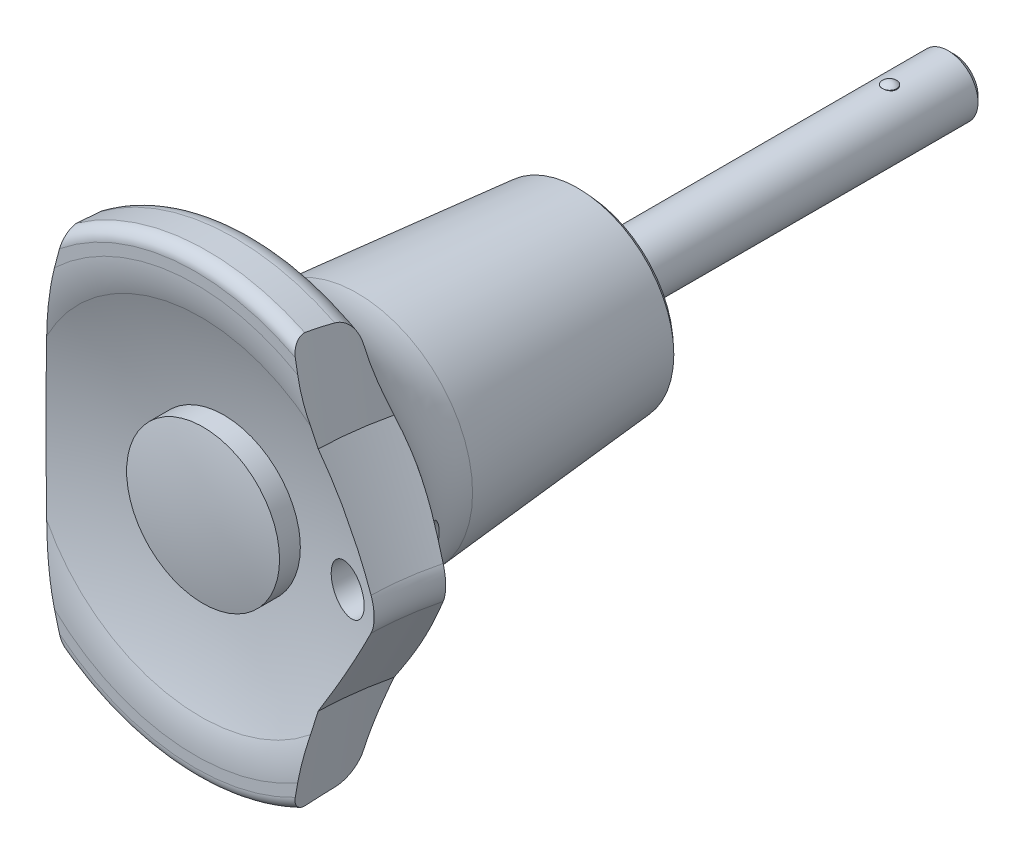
ISO-10303-21;
HEADER;
FILE_DESCRIPTION(('STEP AP214'),'2;1');
FILE_NAME('part.step','',(''),(''),'','','');
FILE_SCHEMA(('AUTOMOTIVE_DESIGN { 1 0 10303 214 1 1 1 1 }'));
ENDSEC;
DATA;
#1=APPLICATION_CONTEXT('core data for automotive mechanical design processes');
#2=APPLICATION_PROTOCOL_DEFINITION('international standard','automotive_design',2000,#1);
#3=PRODUCT_CONTEXT('',#1,'mechanical');
#4=PRODUCT('Part','Part','',(#3));
#5=PRODUCT_RELATED_PRODUCT_CATEGORY('part','',(#4));
#6=PRODUCT_DEFINITION_FORMATION('','',#4);
#7=PRODUCT_DEFINITION_CONTEXT('part definition',#1,'design');
#8=PRODUCT_DEFINITION('design','',#6,#7);
#9=PRODUCT_DEFINITION_SHAPE('','',#8);
#10=(LENGTH_UNIT() NAMED_UNIT(*) SI_UNIT(.MILLI.,.METRE.));
#11=(NAMED_UNIT(*) PLANE_ANGLE_UNIT() SI_UNIT($,.RADIAN.));
#12=(NAMED_UNIT(*) SI_UNIT($,.STERADIAN.) SOLID_ANGLE_UNIT());
#13=UNCERTAINTY_MEASURE_WITH_UNIT(LENGTH_MEASURE(1.E-05),#10,'distance_accuracy_value','');
#14=(GEOMETRIC_REPRESENTATION_CONTEXT(3) GLOBAL_UNCERTAINTY_ASSIGNED_CONTEXT((#13)) GLOBAL_UNIT_ASSIGNED_CONTEXT((#10,
#11,#12)) REPRESENTATION_CONTEXT('',''));
#15=CARTESIAN_POINT('',(0.,0.,0.));
#16=DIRECTION('',(0.,0.,1.));
#17=DIRECTION('',(1.,0.,0.));
#18=AXIS2_PLACEMENT_3D('',#15,#16,#17);
#19=CARTESIAN_POINT('',(0.,1.905,-25.6));
#20=DIRECTION('',(1.,0.,0.));
#21=DIRECTION('',(0.,1.,0.));
#22=AXIS2_PLACEMENT_3D('',#19,#20,#21);
#23=SPHERICAL_SURFACE('',#22,0.845);
#24=CARTESIAN_POINT('',(0.,2.5,-25.6));
#25=DIRECTION('',(0.,1.,0.));
#26=DIRECTION('',(0.,0.,1.));
#27=AXIS2_PLACEMENT_3D('',#24,#25,#26);
#28=CIRCLE('',#27,0.6);
#29=CARTESIAN_POINT('',(0.,2.5,-25.));
#30=VERTEX_POINT('',#29);
#31=CARTESIAN_POINT('',(0.,2.5,-26.2));
#32=VERTEX_POINT('',#31);
#33=EDGE_CURVE('E589',#30,#32,#28,.F.);
#34=ORIENTED_EDGE('',*,*,#33,.F.);
#35=CARTESIAN_POINT('',(0.,2.5,-25.6));
#36=DIRECTION('',(0.,1.,0.));
#37=DIRECTION('',(0.,0.,1.));
#38=AXIS2_PLACEMENT_3D('',#35,#36,#37);
#39=CIRCLE('',#38,0.6);
#40=EDGE_CURVE('E586',#32,#30,#39,.F.);
#41=ORIENTED_EDGE('',*,*,#40,.F.);
#42=EDGE_LOOP('',(#34,#41));
#43=FACE_BOUND('',#42,.T.);
#44=ADVANCED_FACE('F14',(#43),#23,.T.);
#45=CARTESIAN_POINT('',(0.,-1.905,-25.6));
#46=DIRECTION('',(1.,0.,0.));
#47=DIRECTION('',(0.,1.,0.));
#48=AXIS2_PLACEMENT_3D('',#45,#46,#47);
#49=SPHERICAL_SURFACE('',#48,0.845000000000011);
#50=CARTESIAN_POINT('',(0.,-2.5,-25.6));
#51=DIRECTION('',(0.,1.,0.));
#52=DIRECTION('',(0.,0.,1.));
#53=AXIS2_PLACEMENT_3D('',#50,#51,#52);
#54=CIRCLE('',#53,0.6);
#55=CARTESIAN_POINT('',(0.,-2.5,-26.2));
#56=VERTEX_POINT('',#55);
#57=CARTESIAN_POINT('',(0.,-2.5,-25.));
#58=VERTEX_POINT('',#57);
#59=EDGE_CURVE('E29',#56,#58,#54,.T.);
#60=ORIENTED_EDGE('',*,*,#59,.F.);
#61=CARTESIAN_POINT('',(0.,-2.5,-25.6));
#62=DIRECTION('',(0.,1.,0.));
#63=DIRECTION('',(0.,0.,1.));
#64=AXIS2_PLACEMENT_3D('',#61,#62,#63);
#65=CIRCLE('',#64,0.6);
#66=EDGE_CURVE('E578',#58,#56,#65,.T.);
#67=ORIENTED_EDGE('',*,*,#66,.F.);
#68=EDGE_LOOP('',(#60,#67));
#69=FACE_BOUND('',#68,.T.);
#70=ADVANCED_FACE('F556',(#69),#49,.T.);
#71=CARTESIAN_POINT('',(0.,0.,-25.6));
#72=DIRECTION('',(0.,1.,0.));
#73=DIRECTION('',(0.,0.,1.));
#74=AXIS2_PLACEMENT_3D('',#71,#72,#73);
#75=CYLINDRICAL_SURFACE('',#74,0.6);
#76=CARTESIAN_POINT('',(0.,-2.5,-26.2));
#77=CARTESIAN_POINT('',(-0.0332515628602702,-2.50002465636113,-26.2000308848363));
#78=CARTESIAN_POINT('',(-0.0664844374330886,-2.49933737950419,-26.1972379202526));
#79=CARTESIAN_POINT('',(-0.131932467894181,-2.49672415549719,-26.186244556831));
#80=CARTESIAN_POINT('',(-0.164149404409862,-2.4948005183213,-26.1780542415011));
#81=CARTESIAN_POINT('',(-0.226715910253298,-2.48989850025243,-26.1565048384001));
#82=CARTESIAN_POINT('',(-0.257065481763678,-2.4869201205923,-26.1431457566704));
#83=CARTESIAN_POINT('',(-0.315099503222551,-2.48023472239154,-26.1116657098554));
#84=CARTESIAN_POINT('',(-0.342783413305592,-2.47652755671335,-26.0935437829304));
#85=CARTESIAN_POINT('',(-0.395217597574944,-2.46870800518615,-26.052688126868));
#86=CARTESIAN_POINT('',(-0.419910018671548,-2.46458980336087,-26.0298812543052));
#87=CARTESIAN_POINT('',(-0.465160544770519,-2.45645176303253,-25.9804582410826));
#88=CARTESIAN_POINT('',(-0.485717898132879,-2.45243194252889,-25.9538414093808));
#89=CARTESIAN_POINT('',(-0.52238047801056,-2.44488750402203,-25.8971100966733));
#90=CARTESIAN_POINT('',(-0.538421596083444,-2.44137033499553,-25.8669531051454));
#91=CARTESIAN_POINT('',(-0.56518372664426,-2.43531453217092,-25.804274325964));
#92=CARTESIAN_POINT('',(-0.575905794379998,-2.43277570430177,-25.7717530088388));
#93=CARTESIAN_POINT('',(-0.591530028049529,-2.42902371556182,-25.7059050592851));
#94=CARTESIAN_POINT('',(-0.59653641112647,-2.42778684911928,-25.6726045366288));
#95=CARTESIAN_POINT('',(-0.600911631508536,-2.42670778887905,-25.605614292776));
#96=CARTESIAN_POINT('',(-0.600281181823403,-2.42686541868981,-25.5719246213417));
#97=CARTESIAN_POINT('',(-0.593483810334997,-2.42853623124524,-25.5059046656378));
#98=CARTESIAN_POINT('',(-0.587440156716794,-2.43001923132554,-25.4735608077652));
#99=CARTESIAN_POINT('',(-0.570184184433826,-2.43412569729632,-25.4103602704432));
#100=CARTESIAN_POINT('',(-0.558971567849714,-2.43674922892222,-25.3795036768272));
#101=CARTESIAN_POINT('',(-0.531588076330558,-2.442869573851,-25.319817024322));
#102=CARTESIAN_POINT('',(-0.515371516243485,-2.44637437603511,-25.2910087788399));
#103=CARTESIAN_POINT('',(-0.478472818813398,-2.45385760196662,-25.2364784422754));
#104=CARTESIAN_POINT('',(-0.457790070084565,-2.45783609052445,-25.2107567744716));
#105=CARTESIAN_POINT('',(-0.411905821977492,-2.46594592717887,-25.1624241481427));
#106=CARTESIAN_POINT('',(-0.386600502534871,-2.47007855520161,-25.1399118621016));
#107=CARTESIAN_POINT('',(-0.332517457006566,-2.47793815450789,-25.0994272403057));
#108=CARTESIAN_POINT('',(-0.303738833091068,-2.48166502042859,-25.0814560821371));
#109=CARTESIAN_POINT('',(-0.243387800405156,-2.48831007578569,-25.0505305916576));
#110=CARTESIAN_POINT('',(-0.211805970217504,-2.4912253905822,-25.0375940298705));
#111=CARTESIAN_POINT('',(-0.14684958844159,-2.49589464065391,-25.0172569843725));
#112=CARTESIAN_POINT('',(-0.113477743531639,-2.49765027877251,-25.0098483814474));
#113=CARTESIAN_POINT('',(-0.0665184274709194,-2.49915032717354,-25.0035486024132));
#114=CARTESIAN_POINT('',(-0.0532402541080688,-2.49946855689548,-25.0022175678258));
#115=CARTESIAN_POINT('',(-0.0266434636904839,-2.49989326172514,-25.0004443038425));
#116=CARTESIAN_POINT('',(-0.0133249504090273,-2.50000008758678,-25.0000006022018));
#117=CARTESIAN_POINT('',(0.,-2.5,-25.));
#118=B_SPLINE_CURVE_WITH_KNOTS('',3,(#76,#77,#78,#79,#80,#81,#82,#83,#84,#85,#86,#87,#88,#89,
#90,#91,#92,#93,#94,#95,#96,#97,#98,#99,#100,#101,#102,#103,#104,#105,#106,#107,#108,#109,#110,
#111,#112,#113,#114,#115,#116,#117),.UNSPECIFIED.,.F.,.F.,(4,2,2,2,2,2,2,2,2,2,2,2,2,2,2,2,2,2,
2,2,4),(0.,0.0996019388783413,0.199018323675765,0.298434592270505,0.397870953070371,
0.498997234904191,0.600141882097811,0.702657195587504,0.805152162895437,0.905746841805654,
1.00632879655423,1.10467696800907,1.20303080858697,1.30231058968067,1.40160397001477,
1.50348804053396,1.60539850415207,1.70766548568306,1.80978196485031,1.84980265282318,
1.88975688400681),.UNSPECIFIED.);
#119=EDGE_CURVE('E569',#56,#58,#118,.T.);
#120=ORIENTED_EDGE('',*,*,#119,.F.);
#121=ORIENTED_EDGE('',*,*,#59,.T.);
#122=EDGE_LOOP('',(#120,#121));
#123=FACE_BOUND('',#122,.T.);
#124=ADVANCED_FACE('F560',(#123),#75,.T.);
#125=CARTESIAN_POINT('',(0.,0.,-25.6));
#126=DIRECTION('',(0.,1.,0.));
#127=DIRECTION('',(0.,0.,1.));
#128=AXIS2_PLACEMENT_3D('',#125,#126,#127);
#129=CYLINDRICAL_SURFACE('',#128,0.6);
#130=CARTESIAN_POINT('',(0.,2.5,-25.));
#131=CARTESIAN_POINT('',(-0.0332515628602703,2.50002465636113,-24.9999691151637));
#132=CARTESIAN_POINT('',(-0.0664844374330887,2.49933737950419,-25.0027620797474));
#133=CARTESIAN_POINT('',(-0.131932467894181,2.49672415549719,-25.013755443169));
#134=CARTESIAN_POINT('',(-0.164149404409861,2.4948005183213,-25.0219457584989));
#135=CARTESIAN_POINT('',(-0.226715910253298,2.48989850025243,-25.0434951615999));
#136=CARTESIAN_POINT('',(-0.257065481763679,2.4869201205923,-25.0568542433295));
#137=CARTESIAN_POINT('',(-0.315099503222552,2.48023472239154,-25.0883342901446));
#138=CARTESIAN_POINT('',(-0.342783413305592,2.47652755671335,-25.1064562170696));
#139=CARTESIAN_POINT('',(-0.395217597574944,2.46870800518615,-25.147311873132));
#140=CARTESIAN_POINT('',(-0.419910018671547,2.46458980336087,-25.1701187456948));
#141=CARTESIAN_POINT('',(-0.465160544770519,2.45645176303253,-25.2195417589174));
#142=CARTESIAN_POINT('',(-0.485717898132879,2.45243194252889,-25.2461585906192));
#143=CARTESIAN_POINT('',(-0.52238047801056,2.44488750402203,-25.3028899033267));
#144=CARTESIAN_POINT('',(-0.538421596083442,2.44137033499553,-25.3330468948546));
#145=CARTESIAN_POINT('',(-0.565183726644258,2.43531453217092,-25.395725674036));
#146=CARTESIAN_POINT('',(-0.575905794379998,2.43277570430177,-25.4282469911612));
#147=CARTESIAN_POINT('',(-0.591530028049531,2.42902371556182,-25.4940949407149));
#148=CARTESIAN_POINT('',(-0.596536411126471,2.42778684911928,-25.5273954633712));
#149=CARTESIAN_POINT('',(-0.600911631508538,2.42670778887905,-25.5943857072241));
#150=CARTESIAN_POINT('',(-0.600281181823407,2.42686541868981,-25.6280753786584));
#151=CARTESIAN_POINT('',(-0.593483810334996,2.42853623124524,-25.6940953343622));
#152=CARTESIAN_POINT('',(-0.587440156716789,2.43001923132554,-25.7264391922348));
#153=CARTESIAN_POINT('',(-0.57018418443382,2.43412569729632,-25.7896397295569));
#154=CARTESIAN_POINT('',(-0.558971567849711,2.43674922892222,-25.8204963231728));
#155=CARTESIAN_POINT('',(-0.531588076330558,2.442869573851,-25.880182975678));
#156=CARTESIAN_POINT('',(-0.515371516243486,2.44637437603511,-25.9089912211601));
#157=CARTESIAN_POINT('',(-0.478472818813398,2.45385760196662,-25.9635215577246));
#158=CARTESIAN_POINT('',(-0.457790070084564,2.45783609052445,-25.9892432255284));
#159=CARTESIAN_POINT('',(-0.411905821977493,2.46594592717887,-26.0375758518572));
#160=CARTESIAN_POINT('',(-0.386600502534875,2.47007855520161,-26.0600881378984));
#161=CARTESIAN_POINT('',(-0.33251745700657,2.47793815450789,-26.1005727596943));
#162=CARTESIAN_POINT('',(-0.303738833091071,2.48166502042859,-26.1185439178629));
#163=CARTESIAN_POINT('',(-0.243387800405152,2.48831007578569,-26.1494694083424));
#164=CARTESIAN_POINT('',(-0.211805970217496,2.4912253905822,-26.1624059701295));
#165=CARTESIAN_POINT('',(-0.146849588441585,2.49589464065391,-26.1827430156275));
#166=CARTESIAN_POINT('',(-0.113477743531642,2.49765027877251,-26.1901516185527));
#167=CARTESIAN_POINT('',(-0.0665184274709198,2.49915032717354,-26.1964513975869));
#168=CARTESIAN_POINT('',(-0.053240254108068,2.49946855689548,-26.1977824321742));
#169=CARTESIAN_POINT('',(-0.0266434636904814,2.49989326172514,-26.1995556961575));
#170=CARTESIAN_POINT('',(-0.0133249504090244,2.50000008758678,-26.1999993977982));
#171=CARTESIAN_POINT('',(0.,2.5,-26.2));
#172=B_SPLINE_CURVE_WITH_KNOTS('',3,(#130,#131,#132,#133,#134,#135,#136,#137,#138,#139,#140,
#141,#142,#143,#144,#145,#146,#147,#148,#149,#150,#151,#152,#153,#154,#155,#156,#157,#158,#159,
#160,#161,#162,#163,#164,#165,#166,#167,#168,#169,#170,#171),.UNSPECIFIED.,.F.,.F.,(4,2,2,2,2,2,
2,2,2,2,2,2,2,2,2,2,2,2,2,2,4),(0.,0.0996019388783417,0.199018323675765,0.298434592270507,
0.397870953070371,0.498997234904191,0.600141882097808,0.7026571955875,0.805152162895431,
0.905746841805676,1.00632879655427,1.10467696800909,1.20303080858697,1.30231058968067,
1.40160397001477,1.50348804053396,1.60539850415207,1.70766548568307,1.80978196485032,
1.84980265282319,1.88975688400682),.UNSPECIFIED.);
#173=EDGE_CURVE('E577',#30,#32,#172,.T.);
#174=ORIENTED_EDGE('',*,*,#173,.F.);
#175=ORIENTED_EDGE('',*,*,#33,.T.);
#176=EDGE_LOOP('',(#174,#175));
#177=FACE_BOUND('',#176,.T.);
#178=ADVANCED_FACE('F564',(#177),#129,.T.);
#179=CARTESIAN_POINT('',(0.,1.,-31.));
#180=DIRECTION('',(0.,0.,-1.));
#181=DIRECTION('',(-1.,0.,0.));
#182=AXIS2_PLACEMENT_3D('',#179,#180,#181);
#183=PLANE('',#182);
#184=CARTESIAN_POINT('',(0.,0.,-31.0000000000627));
#185=DIRECTION('',(0.,0.,1.));
#186=DIRECTION('',(1.,0.,0.));
#187=AXIS2_PLACEMENT_3D('',#184,#185,#186);
#188=CIRCLE('',#187,1.9999999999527);
#189=CARTESIAN_POINT('',(1.9999999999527,0.,-31.0000000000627));
#190=VERTEX_POINT('',#189);
#191=EDGE_CURVE('E602',#190,#190,#188,.T.);
#192=ORIENTED_EDGE('',*,*,#191,.F.);
#193=EDGE_LOOP('',(#192));
#194=FACE_BOUND('',#193,.T.);
#195=ADVANCED_FACE('F638',(#194),#183,.T.);
#196=CARTESIAN_POINT('',(0.,0.,-25.6));
#197=DIRECTION('',(0.,1.,0.));
#198=DIRECTION('',(0.,0.,1.));
#199=AXIS2_PLACEMENT_3D('',#196,#197,#198);
#200=CYLINDRICAL_SURFACE('',#199,0.6);
#201=CARTESIAN_POINT('',(0.,2.5,-26.2));
#202=CARTESIAN_POINT('',(0.0332515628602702,2.50002465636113,-26.2000308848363));
#203=CARTESIAN_POINT('',(0.0664844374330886,2.49933737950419,-26.1972379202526));
#204=CARTESIAN_POINT('',(0.131932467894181,2.49672415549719,-26.186244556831));
#205=CARTESIAN_POINT('',(0.164149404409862,2.4948005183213,-26.1780542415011));
#206=CARTESIAN_POINT('',(0.226715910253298,2.48989850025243,-26.1565048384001));
#207=CARTESIAN_POINT('',(0.257065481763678,2.4869201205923,-26.1431457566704));
#208=CARTESIAN_POINT('',(0.315099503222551,2.48023472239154,-26.1116657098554));
#209=CARTESIAN_POINT('',(0.342783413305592,2.47652755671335,-26.0935437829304));
#210=CARTESIAN_POINT('',(0.395217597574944,2.46870800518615,-26.052688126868));
#211=CARTESIAN_POINT('',(0.419910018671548,2.46458980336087,-26.0298812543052));
#212=CARTESIAN_POINT('',(0.465160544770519,2.45645176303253,-25.9804582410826));
#213=CARTESIAN_POINT('',(0.485717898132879,2.45243194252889,-25.9538414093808));
#214=CARTESIAN_POINT('',(0.52238047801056,2.44488750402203,-25.8971100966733));
#215=CARTESIAN_POINT('',(0.538421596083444,2.44137033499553,-25.8669531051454));
#216=CARTESIAN_POINT('',(0.56518372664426,2.43531453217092,-25.804274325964));
#217=CARTESIAN_POINT('',(0.575905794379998,2.43277570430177,-25.7717530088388));
#218=CARTESIAN_POINT('',(0.591530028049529,2.42902371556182,-25.7059050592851));
#219=CARTESIAN_POINT('',(0.59653641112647,2.42778684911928,-25.6726045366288));
#220=CARTESIAN_POINT('',(0.600911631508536,2.42670778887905,-25.605614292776));
#221=CARTESIAN_POINT('',(0.600281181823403,2.42686541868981,-25.5719246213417));
#222=CARTESIAN_POINT('',(0.593483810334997,2.42853623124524,-25.5059046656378));
#223=CARTESIAN_POINT('',(0.587440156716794,2.43001923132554,-25.4735608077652));
#224=CARTESIAN_POINT('',(0.570184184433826,2.43412569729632,-25.4103602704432));
#225=CARTESIAN_POINT('',(0.558971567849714,2.43674922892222,-25.3795036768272));
#226=CARTESIAN_POINT('',(0.531588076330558,2.442869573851,-25.319817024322));
#227=CARTESIAN_POINT('',(0.515371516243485,2.44637437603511,-25.2910087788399));
#228=CARTESIAN_POINT('',(0.478472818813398,2.45385760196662,-25.2364784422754));
#229=CARTESIAN_POINT('',(0.457790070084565,2.45783609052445,-25.2107567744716));
#230=CARTESIAN_POINT('',(0.411905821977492,2.46594592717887,-25.1624241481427));
#231=CARTESIAN_POINT('',(0.386600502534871,2.47007855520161,-25.1399118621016));
#232=CARTESIAN_POINT('',(0.332517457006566,2.47793815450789,-25.0994272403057));
#233=CARTESIAN_POINT('',(0.303738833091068,2.48166502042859,-25.0814560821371));
#234=CARTESIAN_POINT('',(0.243387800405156,2.48831007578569,-25.0505305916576));
#235=CARTESIAN_POINT('',(0.211805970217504,2.4912253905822,-25.0375940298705));
#236=CARTESIAN_POINT('',(0.14684958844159,2.49589464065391,-25.0172569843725));
#237=CARTESIAN_POINT('',(0.113477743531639,2.49765027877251,-25.0098483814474));
#238=CARTESIAN_POINT('',(0.0665184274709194,2.49915032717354,-25.0035486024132));
#239=CARTESIAN_POINT('',(0.0532402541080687,2.49946855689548,-25.0022175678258));
#240=CARTESIAN_POINT('',(0.0266434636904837,2.49989326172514,-25.0004443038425));
#241=CARTESIAN_POINT('',(0.0133249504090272,2.50000008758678,-25.0000006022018));
#242=CARTESIAN_POINT('',(0.,2.5,-25.));
#243=B_SPLINE_CURVE_WITH_KNOTS('',3,(#201,#202,#203,#204,#205,#206,#207,#208,#209,#210,#211,
#212,#213,#214,#215,#216,#217,#218,#219,#220,#221,#222,#223,#224,#225,#226,#227,#228,#229,#230,
#231,#232,#233,#234,#235,#236,#237,#238,#239,#240,#241,#242),.UNSPECIFIED.,.F.,.F.,(4,2,2,2,2,2,
2,2,2,2,2,2,2,2,2,2,2,2,2,2,4),(0.,0.0996019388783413,0.199018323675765,0.298434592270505,
0.397870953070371,0.498997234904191,0.600141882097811,0.702657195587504,0.805152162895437,
0.905746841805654,1.00632879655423,1.10467696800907,1.20303080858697,1.30231058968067,
1.40160397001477,1.50348804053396,1.60539850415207,1.70766548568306,1.80978196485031,
1.84980265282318,1.88975688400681),.UNSPECIFIED.);
#244=EDGE_CURVE('E598',#32,#30,#243,.T.);
#245=ORIENTED_EDGE('',*,*,#244,.F.);
#246=ORIENTED_EDGE('',*,*,#40,.T.);
#247=EDGE_LOOP('',(#245,#246));
#248=FACE_BOUND('',#247,.T.);
#249=ADVANCED_FACE('F617',(#248),#200,.T.);
#250=CARTESIAN_POINT('',(0.,0.,-25.6));
#251=DIRECTION('',(0.,1.,0.));
#252=DIRECTION('',(0.,0.,1.));
#253=AXIS2_PLACEMENT_3D('',#250,#251,#252);
#254=CYLINDRICAL_SURFACE('',#253,0.6);
#255=CARTESIAN_POINT('',(0.,-2.5,-25.));
#256=CARTESIAN_POINT('',(0.0332515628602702,-2.50002465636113,-24.9999691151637));
#257=CARTESIAN_POINT('',(0.0664844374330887,-2.49933737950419,-25.0027620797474));
#258=CARTESIAN_POINT('',(0.131932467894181,-2.49672415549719,-25.013755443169));
#259=CARTESIAN_POINT('',(0.164149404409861,-2.4948005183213,-25.0219457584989));
#260=CARTESIAN_POINT('',(0.226715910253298,-2.48989850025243,-25.0434951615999));
#261=CARTESIAN_POINT('',(0.257065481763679,-2.4869201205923,-25.0568542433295));
#262=CARTESIAN_POINT('',(0.315099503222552,-2.48023472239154,-25.0883342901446));
#263=CARTESIAN_POINT('',(0.342783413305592,-2.47652755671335,-25.1064562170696));
#264=CARTESIAN_POINT('',(0.395217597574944,-2.46870800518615,-25.147311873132));
#265=CARTESIAN_POINT('',(0.419910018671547,-2.46458980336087,-25.1701187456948));
#266=CARTESIAN_POINT('',(0.465160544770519,-2.45645176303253,-25.2195417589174));
#267=CARTESIAN_POINT('',(0.485717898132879,-2.45243194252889,-25.2461585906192));
#268=CARTESIAN_POINT('',(0.52238047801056,-2.44488750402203,-25.3028899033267));
#269=CARTESIAN_POINT('',(0.538421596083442,-2.44137033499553,-25.3330468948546));
#270=CARTESIAN_POINT('',(0.565183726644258,-2.43531453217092,-25.395725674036));
#271=CARTESIAN_POINT('',(0.575905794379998,-2.43277570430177,-25.4282469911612));
#272=CARTESIAN_POINT('',(0.591530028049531,-2.42902371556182,-25.4940949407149));
#273=CARTESIAN_POINT('',(0.596536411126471,-2.42778684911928,-25.5273954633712));
#274=CARTESIAN_POINT('',(0.600911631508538,-2.42670778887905,-25.5943857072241));
#275=CARTESIAN_POINT('',(0.600281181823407,-2.42686541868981,-25.6280753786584));
#276=CARTESIAN_POINT('',(0.593483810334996,-2.42853623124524,-25.6940953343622));
#277=CARTESIAN_POINT('',(0.587440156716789,-2.43001923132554,-25.7264391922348));
#278=CARTESIAN_POINT('',(0.57018418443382,-2.43412569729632,-25.7896397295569));
#279=CARTESIAN_POINT('',(0.558971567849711,-2.43674922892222,-25.8204963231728));
#280=CARTESIAN_POINT('',(0.531588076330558,-2.442869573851,-25.880182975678));
#281=CARTESIAN_POINT('',(0.515371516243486,-2.44637437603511,-25.9089912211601));
#282=CARTESIAN_POINT('',(0.478472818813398,-2.45385760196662,-25.9635215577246));
#283=CARTESIAN_POINT('',(0.457790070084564,-2.45783609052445,-25.9892432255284));
#284=CARTESIAN_POINT('',(0.411905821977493,-2.46594592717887,-26.0375758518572));
#285=CARTESIAN_POINT('',(0.386600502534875,-2.47007855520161,-26.0600881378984));
#286=CARTESIAN_POINT('',(0.332517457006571,-2.47793815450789,-26.1005727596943));
#287=CARTESIAN_POINT('',(0.303738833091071,-2.48166502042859,-26.1185439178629));
#288=CARTESIAN_POINT('',(0.243387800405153,-2.48831007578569,-26.1494694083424));
#289=CARTESIAN_POINT('',(0.211805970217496,-2.4912253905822,-26.1624059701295));
#290=CARTESIAN_POINT('',(0.146849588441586,-2.49589464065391,-26.1827430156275));
#291=CARTESIAN_POINT('',(0.113477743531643,-2.49765027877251,-26.1901516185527));
#292=CARTESIAN_POINT('',(0.0665184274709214,-2.49915032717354,-26.1964513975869));
#293=CARTESIAN_POINT('',(0.0532402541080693,-2.49946855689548,-26.1977824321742));
#294=CARTESIAN_POINT('',(0.0266434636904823,-2.49989326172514,-26.1995556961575));
#295=CARTESIAN_POINT('',(0.0133249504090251,-2.50000008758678,-26.1999993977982));
#296=CARTESIAN_POINT('',(0.,-2.5,-26.2));
#297=B_SPLINE_CURVE_WITH_KNOTS('',3,(#255,#256,#257,#258,#259,#260,#261,#262,#263,#264,#265,
#266,#267,#268,#269,#270,#271,#272,#273,#274,#275,#276,#277,#278,#279,#280,#281,#282,#283,#284,
#285,#286,#287,#288,#289,#290,#291,#292,#293,#294,#295,#296),.UNSPECIFIED.,.F.,.F.,(4,2,2,2,2,2,
2,2,2,2,2,2,2,2,2,2,2,2,2,2,4),(0.,0.0996019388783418,0.199018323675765,0.298434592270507,
0.397870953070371,0.498997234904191,0.600141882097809,0.702657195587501,0.805152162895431,
0.905746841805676,1.00632879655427,1.10467696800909,1.20303080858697,1.30231058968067,
1.40160397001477,1.50348804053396,1.60539850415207,1.70766548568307,1.80978196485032,
1.84980265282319,1.88975688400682),.UNSPECIFIED.);
#298=EDGE_CURVE('E595',#58,#56,#297,.T.);
#299=ORIENTED_EDGE('',*,*,#298,.F.);
#300=ORIENTED_EDGE('',*,*,#66,.T.);
#301=EDGE_LOOP('',(#299,#300));
#302=FACE_BOUND('',#301,.T.);
#303=ADVANCED_FACE('F597',(#302),#254,.T.);
#304=CARTESIAN_POINT('',(0.,0.,-30.4999999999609));
#305=DIRECTION('',(0.,0.,1.));
#306=DIRECTION('',(1.,0.,0.));
#307=AXIS2_PLACEMENT_3D('',#304,#305,#306);
#308=CONICAL_SURFACE('',#307,2.50000000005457,0.785398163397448);
#309=ORIENTED_EDGE('',*,*,#191,.T.);
#310=EDGE_LOOP('',(#309));
#311=FACE_BOUND('',#310,.T.);
#312=CARTESIAN_POINT('',(0.,0.,-30.5));
#313=DIRECTION('',(0.,0.,1.));
#314=DIRECTION('',(1.,0.,0.));
#315=AXIS2_PLACEMENT_3D('',#312,#313,#314);
#316=CIRCLE('',#315,2.5);
#317=CARTESIAN_POINT('',(2.5,0.,-30.5));
#318=VERTEX_POINT('',#317);
#319=EDGE_CURVE('E24',#318,#318,#316,.T.);
#320=ORIENTED_EDGE('',*,*,#319,.F.);
#321=EDGE_LOOP('',(#320));
#322=FACE_BOUND('',#321,.T.);
#323=ADVANCED_FACE('F616',(#311,#322),#308,.T.);
#324=CARTESIAN_POINT('',(0.,0.,-7.125));
#325=DIRECTION('',(0.,0.,1.));
#326=DIRECTION('',(1.,0.,0.));
#327=AXIS2_PLACEMENT_3D('',#324,#325,#326);
#328=CYLINDRICAL_SURFACE('',#327,2.5);
#329=CARTESIAN_POINT('',(0.,0.,0.));
#330=DIRECTION('',(0.,0.,-1.));
#331=DIRECTION('',(-1.,0.,0.));
#332=AXIS2_PLACEMENT_3D('',#329,#330,#331);
#333=CIRCLE('',#332,2.5);
#334=CARTESIAN_POINT('',(-2.5,0.,0.));
#335=VERTEX_POINT('',#334);
#336=EDGE_CURVE('E9',#335,#335,#333,.F.);
#337=ORIENTED_EDGE('',*,*,#336,.F.);
#338=EDGE_LOOP('',(#337));
#339=FACE_BOUND('',#338,.T.);
#340=ORIENTED_EDGE('',*,*,#173,.T.);
#341=ORIENTED_EDGE('',*,*,#244,.T.);
#342=EDGE_LOOP('',(#340,#341));
#343=FACE_BOUND('',#342,.T.);
#344=ORIENTED_EDGE('',*,*,#119,.T.);
#345=ORIENTED_EDGE('',*,*,#298,.T.);
#346=EDGE_LOOP('',(#344,#345));
#347=FACE_BOUND('',#346,.T.);
#348=ORIENTED_EDGE('',*,*,#319,.T.);
#349=EDGE_LOOP('',(#348));
#350=FACE_BOUND('',#349,.T.);
#351=ADVANCED_FACE('F16',(#339,#343,#347,#350),#328,.T.);
#352=CARTESIAN_POINT('',(0.,1.03504969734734E-13,0.667307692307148));
#353=DIRECTION('',(1.,0.,0.));
#354=DIRECTION('',(0.,1.,0.));
#355=AXIS2_PLACEMENT_3D('',#352,#353,#354);
#356=SPHERICAL_SURFACE('',#355,31.8326923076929);
#357=CARTESIAN_POINT('',(0.,0.,31.85));
#358=DIRECTION('',(0.,0.,1.));
#359=DIRECTION('',(1.,0.,0.));
#360=AXIS2_PLACEMENT_3D('',#357,#358,#359);
#361=CIRCLE('',#360,6.4);
#362=CARTESIAN_POINT('',(6.4,0.,31.85));
#363=VERTEX_POINT('',#362);
#364=EDGE_CURVE('E523',#363,#363,#361,.F.);
#365=ORIENTED_EDGE('',*,*,#364,.F.);
#366=EDGE_LOOP('',(#365));
#367=FACE_BOUND('',#366,.T.);
#368=ADVANCED_FACE('F528',(#367),#356,.T.);
#369=CARTESIAN_POINT('',(0.,0.,24.05));
#370=DIRECTION('',(0.,0.,1.));
#371=DIRECTION('',(1.,0.,0.));
#372=AXIS2_PLACEMENT_3D('',#369,#370,#371);
#373=CYLINDRICAL_SURFACE('',#372,6.4);
#374=ORIENTED_EDGE('',*,*,#364,.T.);
#375=EDGE_LOOP('',(#374));
#376=FACE_BOUND('',#375,.T.);
#377=CARTESIAN_POINT('',(6.4,0.,30.1110590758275));
#378=CARTESIAN_POINT('',(6.40000129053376,-0.179810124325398,30.111059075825));
#379=CARTESIAN_POINT('',(6.39241914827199,-0.359599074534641,30.1110590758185));
#380=CARTESIAN_POINT('',(6.3621435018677,-0.71795909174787,30.1110590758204));
#381=CARTESIAN_POINT('',(6.33944602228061,-0.896529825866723,30.1110590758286));
#382=CARTESIAN_POINT('',(6.2790684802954,-1.25128110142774,30.1110590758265));
#383=CARTESIAN_POINT('',(6.24137507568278,-1.42745936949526,30.1110590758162));
#384=CARTESIAN_POINT('',(6.15125799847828,-1.77607703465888,30.1110590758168));
#385=CARTESIAN_POINT('',(6.09882894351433,-1.94851504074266,30.1110590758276));
#386=CARTESIAN_POINT('',(5.9796699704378,-2.2882129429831,30.1110590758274));
#387=CARTESIAN_POINT('',(5.91295217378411,-2.45547709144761,30.1110590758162));
#388=CARTESIAN_POINT('',(5.76563661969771,-2.7838514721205,30.1110590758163));
#389=CARTESIAN_POINT('',(5.68503375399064,-2.9449594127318,30.1110590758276));
#390=CARTESIAN_POINT('',(5.51059240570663,-3.25971260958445,30.1110590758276));
#391=CARTESIAN_POINT('',(5.4167621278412,-3.41336241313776,30.1110590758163));
#392=CARTESIAN_POINT('',(5.21645805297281,-3.71226938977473,30.1110590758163));
#393=CARTESIAN_POINT('',(5.10997960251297,-3.85752344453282,30.1110590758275));
#394=CARTESIAN_POINT('',(4.88519374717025,-4.13850742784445,30.1110590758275));
#395=CARTESIAN_POINT('',(4.76688947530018,-4.27423986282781,30.1110590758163));
#396=CARTESIAN_POINT('',(4.51922341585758,-4.53530651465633,30.1110590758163));
#397=CARTESIAN_POINT('',(4.38985756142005,-4.66063687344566,30.1110590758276));
#398=CARTESIAN_POINT('',(4.12107041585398,-4.89991253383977,30.1110590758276));
#399=CARTESIAN_POINT('',(3.98165245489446,-5.01386157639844,30.1110590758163));
#400=CARTESIAN_POINT('',(3.69366097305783,-5.22965167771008,30.1110590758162));
#401=CARTESIAN_POINT('',(3.54508409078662,-5.33148825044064,30.1110590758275));
#402=CARTESIAN_POINT('',(3.23993719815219,-5.52224318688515,30.1110590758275));
#403=CARTESIAN_POINT('',(3.08337030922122,-5.61116654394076,30.1110590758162));
#404=CARTESIAN_POINT('',(2.76324420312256,-5.77554056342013,30.1110590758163));
#405=CARTESIAN_POINT('',(2.59968242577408,-5.85098623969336,30.1110590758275));
#406=CARTESIAN_POINT('',(2.2668445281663,-5.98780235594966,30.1110590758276));
#407=CARTESIAN_POINT('',(2.0975705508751,-6.04917800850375,30.1110590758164));
#408=CARTESIAN_POINT('',(1.75439473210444,-6.15747441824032,30.1110590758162));
#409=CARTESIAN_POINT('',(1.58049120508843,-6.20438983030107,30.1110590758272));
#410=CARTESIAN_POINT('',(1.22940084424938,-6.283384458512,30.1110590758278));
#411=CARTESIAN_POINT('',(1.05221523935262,-6.31546911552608,30.1110590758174));
#412=CARTESIAN_POINT('',(0.695754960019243,-6.36461764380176,30.1110590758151));
#413=CARTESIAN_POINT('',(0.516479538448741,-6.38167596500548,30.1110590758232));
#414=CARTESIAN_POINT('',(-0.0224375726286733,-6.41003711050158,30.1110590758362));
#415=CARTESIAN_POINT('',(-0.383552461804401,-6.39861178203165,30.1110590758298));
#416=CARTESIAN_POINT('',(-1.09854136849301,-6.31529390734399,30.1110590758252));
#417=CARTESIAN_POINT('',(-1.45241538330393,-6.24340133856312,30.1110590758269));
#418=CARTESIAN_POINT('',(-2.14312422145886,-6.04122706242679,30.1110590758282));
#419=CARTESIAN_POINT('',(-2.47995902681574,-5.91094529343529,30.1110590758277));
#420=CARTESIAN_POINT('',(-3.12696102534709,-5.59568095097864,30.1110590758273));
#421=CARTESIAN_POINT('',(-3.43712822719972,-5.41069839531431,30.1110590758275));
#422=CARTESIAN_POINT('',(-4.02200801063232,-4.99128634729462,30.1110590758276));
#423=CARTESIAN_POINT('',(-4.29672060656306,-4.75685687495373,30.1110590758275));
#424=CARTESIAN_POINT('',(-4.80288833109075,-4.24520495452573,30.1110590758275));
#425=CARTESIAN_POINT('',(-5.03434345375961,-3.96798250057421,30.1110590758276));
#426=CARTESIAN_POINT('',(-5.4474271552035,-3.37861432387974,30.1110590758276));
#427=CARTESIAN_POINT('',(-5.62905572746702,-3.06646859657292,30.1110590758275));
#428=CARTESIAN_POINT('',(-5.9373300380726,-2.41611476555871,30.1110590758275));
#429=CARTESIAN_POINT('',(-6.06397577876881,-2.0779066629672,30.1110590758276));
#430=CARTESIAN_POINT('',(-6.25868942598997,-1.38502883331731,30.1110590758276));
#431=CARTESIAN_POINT('',(-6.32675733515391,-1.03035910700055,30.1110590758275));
#432=CARTESIAN_POINT('',(-6.40238305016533,-0.314626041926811,30.1110590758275));
#433=CARTESIAN_POINT('',(-6.4099408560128,0.0464372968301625,30.1110590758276));
#434=CARTESIAN_POINT('',(-6.36433185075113,0.764708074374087,30.1110590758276));
#435=CARTESIAN_POINT('',(-6.31116503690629,1.12191551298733,30.1110590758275));
#436=CARTESIAN_POINT('',(-6.14561593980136,1.82233442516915,30.1110590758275));
#437=CARTESIAN_POINT('',(-6.0332336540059,2.16554589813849,30.1110590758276));
#438=CARTESIAN_POINT('',(-5.75244417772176,2.82823003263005,30.1110590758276));
#439=CARTESIAN_POINT('',(-5.58403699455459,3.14770269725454,30.1110590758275));
#440=CARTESIAN_POINT('',(-5.19597704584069,3.75384041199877,30.1110590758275));
#441=CARTESIAN_POINT('',(-4.97632428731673,4.04050546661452,30.1110590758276));
#442=CARTESIAN_POINT('',(-4.49201316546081,4.57289025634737,30.1110590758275));
#443=CARTESIAN_POINT('',(-4.22735478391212,4.81860997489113,30.1110590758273));
#444=CARTESIAN_POINT('',(-3.66052736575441,5.26212983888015,30.1110590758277));
#445=CARTESIAN_POINT('',(-3.35835831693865,5.45992996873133,30.1110590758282));
#446=CARTESIAN_POINT('',(-2.72515445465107,5.80199137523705,30.111059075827));
#447=CARTESIAN_POINT('',(-2.39411967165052,5.94625270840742,30.1110590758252));
#448=CARTESIAN_POINT('',(-1.71233203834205,6.17715664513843,30.1110590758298));
#449=CARTESIAN_POINT('',(-1.3615791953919,6.26379927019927,30.1110590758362));
#450=CARTESIAN_POINT('',(-0.828635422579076,6.34869298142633,30.1110590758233));
#451=CARTESIAN_POINT('',(-0.649753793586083,6.36947821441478,30.1110590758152));
#452=CARTESIAN_POINT('',(-0.29089341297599,6.3959118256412,30.1110590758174));
#453=CARTESIAN_POINT('',(-0.110915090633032,6.40156578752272,30.1110590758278));
#454=CARTESIAN_POINT('',(0.248931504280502,6.39769010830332,30.1110590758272));
#455=CARTESIAN_POINT('',(0.42879971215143,6.38815488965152,30.1110590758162));
#456=CARTESIAN_POINT('',(0.787030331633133,6.35397041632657,30.1110590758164));
#457=CARTESIAN_POINT('',(0.965393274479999,6.32932674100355,30.1110590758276));
#458=CARTESIAN_POINT('',(1.31947460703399,6.2650918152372,30.1110590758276));
#459=CARTESIAN_POINT('',(1.49519199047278,6.22549501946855,30.1110590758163));
#460=CARTESIAN_POINT('',(1.84260157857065,6.13165408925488,30.1110590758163));
#461=CARTESIAN_POINT('',(2.01429524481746,6.07741536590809,30.1110590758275));
#462=CARTESIAN_POINT('',(2.35256975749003,5.95464555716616,30.1110590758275));
#463=CARTESIAN_POINT('',(2.51914859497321,5.88610893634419,30.1110590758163));
#464=CARTESIAN_POINT('',(2.84587864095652,5.73527147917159,30.1110590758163));
#465=CARTESIAN_POINT('',(3.00603219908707,5.65297573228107,30.1110590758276));
#466=CARTESIAN_POINT('',(3.31889024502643,5.47515780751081,30.1110590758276));
#467=CARTESIAN_POINT('',(3.47159225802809,5.37963127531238,30.1110590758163));
#468=CARTESIAN_POINT('',(3.76834973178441,5.17608944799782,30.1110590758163));
#469=CARTESIAN_POINT('',(3.91240836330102,5.06807877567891,30.1110590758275));
#470=CARTESIAN_POINT('',(4.19095341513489,4.84027769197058,30.1110590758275));
#471=CARTESIAN_POINT('',(4.32543729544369,4.72048417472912,30.1110590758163));
#472=CARTESIAN_POINT('',(4.58378691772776,4.47003941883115,30.1110590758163));
#473=CARTESIAN_POINT('',(4.70765655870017,4.33939220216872,30.1110590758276));
#474=CARTESIAN_POINT('',(4.94402627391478,4.0680460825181,30.1110590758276));
#475=CARTESIAN_POINT('',(5.05651927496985,3.92734101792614,30.1110590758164));
#476=CARTESIAN_POINT('',(5.26920889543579,3.63700546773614,30.1110590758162));
#477=CARTESIAN_POINT('',(5.36941003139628,3.48737829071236,30.1110590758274));
#478=CARTESIAN_POINT('',(5.55693134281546,3.18008480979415,30.1110590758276));
#479=CARTESIAN_POINT('',(5.6442405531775,3.02241181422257,30.1110590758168));
#480=CARTESIAN_POINT('',(5.80522542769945,2.70032605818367,30.1110590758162));
#481=CARTESIAN_POINT('',(5.87890606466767,2.53591578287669,30.1110590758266));
#482=CARTESIAN_POINT('',(6.01208998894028,2.20161657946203,30.1110590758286));
#483=CARTESIAN_POINT('',(6.07160584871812,2.03173266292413,30.1110590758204));
#484=CARTESIAN_POINT('',(6.17610679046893,1.68761339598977,30.1110590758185));
#485=CARTESIAN_POINT('',(6.22109569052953,1.51337920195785,30.111059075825));
#486=CARTESIAN_POINT('',(6.30560169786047,1.11794110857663,30.1110590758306));
#487=CARTESIAN_POINT('',(6.34097102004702,0.895838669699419,30.1110590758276));
#488=CARTESIAN_POINT('',(6.38816936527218,0.449146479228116,30.1110590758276));
#489=CARTESIAN_POINT('',(6.39999838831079,0.224556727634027,30.1110590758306));
#490=CARTESIAN_POINT('',(6.4,0.,30.1110590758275));
#491=B_SPLINE_CURVE_WITH_KNOTS('',3,(#377,#378,#379,#380,#381,#382,#383,#384,#385,#386,#387,
#388,#389,#390,#391,#392,#393,#394,#395,#396,#397,#398,#399,#400,#401,#402,#403,#404,#405,#406,
#407,#408,#409,#410,#411,#412,#413,#414,#415,#416,#417,#418,#419,#420,#421,#422,#423,#424,#425,
#426,#427,#428,#429,#430,#431,#432,#433,#434,#435,#436,#437,#438,#439,#440,#441,#442,#443,#444,
#445,#446,#447,#448,#449,#450,#451,#452,#453,#454,#455,#456,#457,#458,#459,#460,#461,#462,#463,
#464,#465,#466,#467,#468,#469,#470,#471,#472,#473,#474,#475,#476,#477,#478,#479,#480,#481,#482,
#483,#484,#485,#486,#487,#488,#489,#490),.UNSPECIFIED.,.T.,.F.,(4,2,2,2,2,2,2,2,2,2,2,2,2,2,2,2,
2,2,2,2,2,2,2,2,2,2,2,2,2,2,2,2,2,2,2,2,2,2,2,2,2,2,2,2,2,2,2,2,2,2,2,2,2,2,2,2,4),(0.,
0.539234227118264,1.07861033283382,1.61846741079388,2.15852193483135,2.69812012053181,
3.23791724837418,3.77738101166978,4.31704387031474,4.85656413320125,5.39628361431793,
5.93582510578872,6.47556580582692,7.01509723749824,7.55482786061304,8.09435820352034,
8.63408774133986,9.17361911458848,9.71334968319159,10.7916501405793,11.8699510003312,
12.9482529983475,14.0265546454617,15.1048558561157,16.1831572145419,17.2614587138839,
18.3397601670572,19.4180615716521,20.4963629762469,21.5746644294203,22.6529659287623,
23.7312672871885,24.8095684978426,25.8878701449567,26.966172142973,28.0444730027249,
29.1227734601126,29.6625040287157,30.2020354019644,30.7417649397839,31.2812952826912,
31.821025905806,32.3605573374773,32.9002980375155,33.4398395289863,33.979559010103,
34.5190792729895,35.0587421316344,35.59820589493,36.1380030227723,36.6776012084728,
37.2176557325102,37.7575128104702,38.2968889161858,38.836123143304,39.5095483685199,
40.1829735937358),.UNSPECIFIED.);
#492=CARTESIAN_POINT('',(6.4,0.,30.1110590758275));
#493=VERTEX_POINT('',#492);
#494=EDGE_CURVE('E537',#493,#493,#491,.T.);
#495=ORIENTED_EDGE('',*,*,#494,.F.);
#496=EDGE_LOOP('',(#495));
#497=FACE_BOUND('',#496,.T.);
#498=ADVANCED_FACE('F531',(#376,#497),#373,.T.);
#499=CARTESIAN_POINT('',(0.,0.,31.5));
#500=DIRECTION('',(0.,0.,1.));
#501=DIRECTION('',(1.,0.,0.));
#502=AXIS2_PLACEMENT_3D('',#499,#500,#501);
#503=CONICAL_SURFACE('',#502,19.,0.0872664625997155);
#504=CARTESIAN_POINT('',(-11.2367166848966,-15.0725210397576,29.2154159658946));
#505=CARTESIAN_POINT('',(-11.2176777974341,-15.0969210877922,29.3089473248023));
#506=CARTESIAN_POINT('',(-11.1992554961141,-15.1208018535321,29.4027394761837));
#507=CARTESIAN_POINT('',(-11.1636714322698,-15.1675195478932,29.5907332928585));
#508=CARTESIAN_POINT('',(-11.1465086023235,-15.1903573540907,29.6849345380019));
#509=CARTESIAN_POINT('',(-11.1134475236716,-15.2350129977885,29.8737414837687));
#510=CARTESIAN_POINT('',(-11.0975485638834,-15.2568314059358,29.9683469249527));
#511=CARTESIAN_POINT('',(-11.0670196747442,-15.2994695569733,30.1579580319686));
#512=CARTESIAN_POINT('',(-11.0523893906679,-15.3202895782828,30.2529635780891));
#513=CARTESIAN_POINT('',(-11.0244032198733,-15.3609498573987,30.4433702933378));
#514=CARTESIAN_POINT('',(-11.0110473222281,-15.3807901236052,30.5387714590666));
#515=CARTESIAN_POINT('',(-10.9856156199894,-15.4195080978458,30.7299680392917));
#516=CARTESIAN_POINT('',(-10.973540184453,-15.4383855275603,30.8257635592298));
#517=CARTESIAN_POINT('',(-10.9506761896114,-15.4751926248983,31.0177468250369));
#518=CARTESIAN_POINT('',(-10.9398883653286,-15.4931217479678,31.1139347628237));
#519=CARTESIAN_POINT('',(-10.9196071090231,-15.5280445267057,31.3067014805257));
#520=CARTESIAN_POINT('',(-10.9101147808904,-15.5450373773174,31.4032805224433));
#521=CARTESIAN_POINT('',(-10.9012791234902,-15.5615588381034,31.5));
#522=B_SPLINE_CURVE_WITH_KNOTS('',3,(#504,#505,#506,#507,#508,#509,#510,#511,#512,#513,#514,
#515,#516,#517,#518,#519,#520,#521),.UNSPECIFIED.,.F.,.F.,(4,2,2,2,2,2,2,2,4),(0.,
0.295552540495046,0.59085163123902,0.885983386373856,1.18103235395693,1.47607879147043,
1.77121003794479,2.06650896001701,2.36205795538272),.UNSPECIFIED.);
#523=CARTESIAN_POINT('',(-11.2367166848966,-15.0725210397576,29.2154159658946));
#524=VERTEX_POINT('',#523);
#525=CARTESIAN_POINT('',(-10.9012791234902,-15.5615588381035,31.5));
#526=VERTEX_POINT('',#525);
#527=EDGE_CURVE('E306',#524,#526,#522,.T.);
#528=ORIENTED_EDGE('',*,*,#527,.F.);
#529=CARTESIAN_POINT('',(0.,0.,29.2154159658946));
#530=DIRECTION('',(0.,0.,1.));
#531=DIRECTION('',(1.,0.,0.));
#532=AXIS2_PLACEMENT_3D('',#529,#530,#531);
#533=CIRCLE('',#532,18.8001247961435);
#534=CARTESIAN_POINT('',(8.390310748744,-16.8240119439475,29.2154159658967));
#535=VERTEX_POINT('',#534);
#536=EDGE_CURVE('E421',#535,#524,#533,.F.);
#537=ORIENTED_EDGE('',*,*,#536,.F.);
#538=CARTESIAN_POINT('',(8.39031074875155,-16.8240119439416,29.2154159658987));
#539=CARTESIAN_POINT('',(8.3637188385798,-16.8557405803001,29.4043278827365));
#540=CARTESIAN_POINT('',(8.33910921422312,-16.886400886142,29.5936974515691));
#541=CARTESIAN_POINT('',(8.29388552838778,-16.9456264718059,29.9731315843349));
#542=CARTESIAN_POINT('',(8.27326927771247,-16.9741928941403,30.1631957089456));
#543=CARTESIAN_POINT('',(8.23603410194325,-17.0293070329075,30.5440061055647));
#544=CARTESIAN_POINT('',(8.21941516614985,-17.0558547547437,30.7347523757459));
#545=CARTESIAN_POINT('',(8.19018148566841,-17.106988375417,31.1169213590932));
#546=CARTESIAN_POINT('',(8.17756894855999,-17.1315731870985,31.3083443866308));
#547=CARTESIAN_POINT('',(8.16697223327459,-17.155190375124,31.4999976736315));
#548=B_SPLINE_CURVE_WITH_KNOTS('',3,(#538,#539,#540,#541,#542,#543,#544,#545,#546,#547),
.UNSPECIFIED.,.F.,.F.,(4,2,2,2,4),(0.,0.580169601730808,1.1600202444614,1.73986933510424,
2.3200373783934),.UNSPECIFIED.);
#549=CARTESIAN_POINT('',(8.16697214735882,-17.1551906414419,31.4999988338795));
#550=VERTEX_POINT('',#549);
#551=EDGE_CURVE('E386',#535,#550,#548,.T.);
#552=ORIENTED_EDGE('',*,*,#551,.T.);
#553=CARTESIAN_POINT('',(0.,0.,31.5));
#554=DIRECTION('',(0.,0.,1.));
#555=DIRECTION('',(1.,0.,0.));
#556=AXIS2_PLACEMENT_3D('',#553,#554,#555);
#557=CIRCLE('',#556,19.);
#558=EDGE_CURVE('E271',#526,#550,#557,.T.);
#559=ORIENTED_EDGE('',*,*,#558,.F.);
#560=EDGE_LOOP('',(#528,#537,#552,#559));
#561=FACE_BOUND('',#560,.T.);
#562=ADVANCED_FACE('F283',(#561),#503,.T.);
#563=CARTESIAN_POINT('',(0.,0.,31.5));
#564=DIRECTION('',(0.,0.,1.));
#565=DIRECTION('',(1.,0.,0.));
#566=AXIS2_PLACEMENT_3D('',#563,#564,#565);
#567=TOROIDAL_SURFACE('',#566,18.,1.);
#568=CARTESIAN_POINT('',(8.16697219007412,-17.1551906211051,31.4999976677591));
#569=CARTESIAN_POINT('',(8.16610411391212,-17.1556060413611,31.5236792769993));
#570=CARTESIAN_POINT('',(8.16544722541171,-17.1549841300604,31.5473747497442));
#571=CARTESIAN_POINT('',(8.1645568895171,-17.1516830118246,31.5946216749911));
#572=CARTESIAN_POINT('',(8.16432329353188,-17.1490045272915,31.6181731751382));
#573=CARTESIAN_POINT('',(8.16425861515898,-17.1379549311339,31.6880923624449));
#574=CARTESIAN_POINT('',(8.16505301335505,-17.1265741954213,31.7340189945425));
#575=CARTESIAN_POINT('',(8.16821542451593,-17.0963987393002,31.8232098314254));
#576=CARTESIAN_POINT('',(8.17058197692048,-17.077610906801,31.8664764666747));
#577=CARTESIAN_POINT('',(8.17670292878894,-17.0335448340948,31.9494901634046));
#578=CARTESIAN_POINT('',(8.18045877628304,-17.008259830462,31.9892334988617));
#579=CARTESIAN_POINT('',(8.18937318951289,-16.9507343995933,32.0665851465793));
#580=CARTESIAN_POINT('',(8.19459729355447,-16.9181889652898,32.1039574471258));
#581=CARTESIAN_POINT('',(8.20607879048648,-16.8482742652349,32.1736619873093));
#582=CARTESIAN_POINT('',(8.21233651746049,-16.8109034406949,32.2059925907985));
#583=CARTESIAN_POINT('',(8.22684468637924,-16.7253510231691,32.2708321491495));
#584=CARTESIAN_POINT('',(8.23525121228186,-16.6764328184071,32.3023321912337));
#585=CARTESIAN_POINT('',(8.25285140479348,-16.574800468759,32.3582132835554));
#586=CARTESIAN_POINT('',(8.26204594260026,-16.5220821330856,32.3825863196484));
#587=CARTESIAN_POINT('',(8.28291939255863,-16.4028452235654,32.4286926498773));
#588=CARTESIAN_POINT('',(8.29471820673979,-16.3357312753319,32.4488314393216));
#589=CARTESIAN_POINT('',(8.31870582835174,-16.1994743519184,32.4792714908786));
#590=CARTESIAN_POINT('',(8.33089427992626,-16.1303332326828,32.4895814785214));
#591=CARTESIAN_POINT('',(8.35033301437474,-16.0200876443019,32.4983819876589));
#592=CARTESIAN_POINT('',(8.35754198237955,-15.9792076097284,32.4999965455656));
#593=CARTESIAN_POINT('',(8.36474497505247,-15.9383512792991,32.5));
#594=B_SPLINE_CURVE_WITH_KNOTS('',3,(#568,#569,#570,#571,#572,#573,#574,#575,#576,#577,#578,
#579,#580,#581,#582,#583,#584,#585,#586,#587,#588,#589,#590,#591,#592,#593),.UNSPECIFIED.,.F.,
.F.,(4,2,2,2,2,2,2,2,2,2,2,2,4),(0.,0.0710563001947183,0.142087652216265,0.283279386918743,
0.424340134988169,0.565548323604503,0.714487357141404,0.863474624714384,1.03919502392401,
1.21511226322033,1.42749571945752,1.63969045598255,1.76417409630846),.UNSPECIFIED.);
#595=CARTESIAN_POINT('',(8.3647449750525,-15.9383512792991,32.5));
#596=VERTEX_POINT('',#595);
#597=EDGE_CURVE('E412',#550,#596,#594,.T.);
#598=ORIENTED_EDGE('',*,*,#597,.T.);
#599=CARTESIAN_POINT('',(0.,0.,32.5));
#600=DIRECTION('',(0.,0.,-1.));
#601=DIRECTION('',(0.464708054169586,-0.885463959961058,0.));
#602=AXIS2_PLACEMENT_3D('',#599,#600,#601);
#603=CIRCLE('',#602,18.);
#604=CARTESIAN_POINT('',(-11.3643421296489,-13.9589300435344,32.5));
#605=VERTEX_POINT('',#604);
#606=EDGE_CURVE('E273',#596,#605,#603,.T.);
#607=ORIENTED_EDGE('',*,*,#606,.T.);
#608=CARTESIAN_POINT('',(-10.9012791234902,-15.5615588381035,31.5));
#609=CARTESIAN_POINT('',(-10.9003438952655,-15.562220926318,31.519597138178));
#610=CARTESIAN_POINT('',(-10.8997291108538,-15.5619414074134,31.5392381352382));
#611=CARTESIAN_POINT('',(-10.8991336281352,-15.5595372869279,31.578399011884));
#612=CARTESIAN_POINT('',(-10.899152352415,-15.5574143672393,31.5979189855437));
#613=CARTESIAN_POINT('',(-10.8998117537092,-15.5513959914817,31.6364519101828));
#614=CARTESIAN_POINT('',(-10.900445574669,-15.5475203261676,31.6554680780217));
#615=CARTESIAN_POINT('',(-10.9022952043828,-15.538100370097,31.6930495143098));
#616=CARTESIAN_POINT('',(-10.9035110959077,-15.5325558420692,31.7116147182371));
#617=CARTESIAN_POINT('',(-10.9079642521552,-15.513639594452,31.7662967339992));
#618=CARTESIAN_POINT('',(-10.9120104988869,-15.4979570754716,31.8015699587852));
#619=CARTESIAN_POINT('',(-10.921871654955,-15.4615597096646,31.8691876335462));
#620=CARTESIAN_POINT('',(-10.9276916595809,-15.4408304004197,31.9015232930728));
#621=CARTESIAN_POINT('',(-10.9437801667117,-15.3847135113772,31.9775962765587));
#622=CARTESIAN_POINT('',(-10.9548494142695,-15.3470363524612,32.0194688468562));
#623=CARTESIAN_POINT('',(-10.9789210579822,-15.2660028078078,32.0965940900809));
#624=CARTESIAN_POINT('',(-10.9919272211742,-15.2226353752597,32.1318335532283));
#625=CARTESIAN_POINT('',(-11.0164966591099,-15.1409700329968,32.1900227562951));
#626=CARTESIAN_POINT('',(-11.0278431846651,-15.1033442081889,32.2140275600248));
#627=CARTESIAN_POINT('',(-11.0510946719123,-15.0262383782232,32.2585547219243));
#628=CARTESIAN_POINT('',(-11.0629999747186,-14.9867572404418,32.2790749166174));
#629=CARTESIAN_POINT('',(-11.0993633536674,-14.8659544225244,32.336033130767));
#630=CARTESIAN_POINT('',(-11.1243913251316,-14.7825291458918,32.3676959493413));
#631=CARTESIAN_POINT('',(-11.1676001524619,-14.6374456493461,32.4125439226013));
#632=CARTESIAN_POINT('',(-11.1856508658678,-14.5765290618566,32.428424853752));
#633=CARTESIAN_POINT('',(-11.2218572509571,-14.4535941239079,32.4552558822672));
#634=CARTESIAN_POINT('',(-11.2400129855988,-14.3915750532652,32.4662026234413));
#635=CARTESIAN_POINT('',(-11.2759741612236,-14.2678970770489,32.4833586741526));
#636=CARTESIAN_POINT('',(-11.2937805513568,-14.2062483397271,32.4896411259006));
#637=CARTESIAN_POINT('',(-11.3292128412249,-14.0827169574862,32.4979501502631));
#638=CARTESIAN_POINT('',(-11.3468389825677,-14.0208348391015,32.4999834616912));
#639=CARTESIAN_POINT('',(-11.3643421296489,-13.9589300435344,32.5));
#640=B_SPLINE_CURVE_WITH_KNOTS('',3,(#608,#609,#610,#611,#612,#613,#614,#615,#616,#617,#618,
#619,#620,#621,#622,#623,#624,#625,#626,#627,#628,#629,#630,#631,#632,#633,#634,#635,#636,#637,
#638,#639),.UNSPECIFIED.,.F.,.F.,(4,2,2,2,2,2,2,2,2,2,2,2,2,2,2,4),(0.,0.0588622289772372,
0.117670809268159,0.175831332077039,0.234000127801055,0.349828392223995,0.46599257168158,
0.637243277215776,0.808831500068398,0.946792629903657,1.08483910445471,1.36187646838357,
1.55817913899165,1.75461513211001,1.94790162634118,2.14088134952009),.UNSPECIFIED.);
#641=EDGE_CURVE('E304',#526,#605,#640,.T.);
#642=ORIENTED_EDGE('',*,*,#641,.F.);
#643=ORIENTED_EDGE('',*,*,#558,.T.);
#644=EDGE_LOOP('',(#598,#607,#642,#643));
#645=FACE_BOUND('',#644,.T.);
#646=ADVANCED_FACE('F278',(#645),#567,.T.);
#647=CARTESIAN_POINT('',(0.,17.5437477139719,32.5));
#648=DIRECTION('',(0.,0.,1.));
#649=DIRECTION('',(1.,0.,0.));
#650=AXIS2_PLACEMENT_3D('',#647,#648,#649);
#651=PLANE('',#650);
#652=DIRECTION('',(0.173648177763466,0.984807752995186,0.));
#653=VECTOR('',#652,1.);
#654=CARTESIAN_POINT('',(8.36474497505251,-15.9383512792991,32.5));
#655=LINE('',#654,#653);
#656=CARTESIAN_POINT('',(8.56828638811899,-14.7840105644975,32.5));
#657=VERTEX_POINT('',#656);
#658=EDGE_CURVE('E496',#596,#657,#655,.T.);
#659=ORIENTED_EDGE('',*,*,#658,.T.);
#660=CARTESIAN_POINT('',(0.,0.,32.4999999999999));
#661=DIRECTION('',(0.,0.,1.));
#662=DIRECTION('',(-0.689722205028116,-0.724074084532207,0.));
#663=AXIS2_PLACEMENT_3D('',#660,#661,#662);
#664=CIRCLE('',#663,17.0874954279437);
#665=CARTESIAN_POINT('',(-11.785625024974,-12.3726126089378,32.5));
#666=VERTEX_POINT('',#665);
#667=EDGE_CURVE('E511',#666,#657,#664,.T.);
#668=ORIENTED_EDGE('',*,*,#667,.F.);
#669=CARTESIAN_POINT('',(-11.7856250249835,-12.3726126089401,32.5));
#670=CARTESIAN_POINT('',(-11.7196408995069,-12.6381221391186,32.5));
#671=CARTESIAN_POINT('',(-11.6515419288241,-12.9030700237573,32.5));
#672=CARTESIAN_POINT('',(-11.5111142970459,-13.4318425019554,32.5));
#673=CARTESIAN_POINT('',(-11.4387856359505,-13.6956670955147,32.5));
#674=CARTESIAN_POINT('',(-11.3643421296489,-13.9589300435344,32.5));
#675=B_SPLINE_CURVE_WITH_KNOTS('',3,(#669,#670,#671,#672,#673,#674),.UNSPECIFIED.,.F.,.F.,(4,2,
4),(0.,0.820678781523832,1.64135756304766),.UNSPECIFIED.);
#676=EDGE_CURVE('E498',#666,#605,#675,.T.);
#677=ORIENTED_EDGE('',*,*,#676,.T.);
#678=ORIENTED_EDGE('',*,*,#606,.F.);
#679=EDGE_LOOP('',(#659,#668,#677,#678));
#680=FACE_BOUND('',#679,.T.);
#681=ADVANCED_FACE('F282',(#680),#651,.T.);
#682=CARTESIAN_POINT('',(0.,0.,24.5));
#683=DIRECTION('',(0.,0.,1.));
#684=DIRECTION('',(1.,0.,0.));
#685=AXIS2_PLACEMENT_3D('',#682,#683,#684);
#686=TOROIDAL_SURFACE('',#685,17.0874954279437,7.99999999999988);
#687=CARTESIAN_POINT('',(8.56828638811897,-14.7840105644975,32.5));
#688=CARTESIAN_POINT('',(8.5896613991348,-14.6627899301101,32.5000006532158));
#689=CARTESIAN_POINT('',(8.61103482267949,-14.5415725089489,32.4983376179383));
#690=CARTESIAN_POINT('',(8.65372276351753,-14.29948302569,32.4918128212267));
#691=CARTESIAN_POINT('',(8.67503730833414,-14.1786107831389,32.4869579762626));
#692=CARTESIAN_POINT('',(8.71761251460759,-13.9372058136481,32.474186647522));
#693=CARTESIAN_POINT('',(8.73887320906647,-13.8166728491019,32.4662747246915));
#694=CARTESIAN_POINT('',(8.78134941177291,-13.5759389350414,32.4475220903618));
#695=CARTESIAN_POINT('',(8.80256494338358,-13.4557377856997,32.4366839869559));
#696=CARTESIAN_POINT('',(8.84496131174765,-13.2156611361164,32.4122083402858));
#697=CARTESIAN_POINT('',(8.86614215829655,-13.0957855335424,32.398571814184));
#698=CARTESIAN_POINT('',(8.9084717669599,-12.8564090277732,32.3686342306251));
#699=CARTESIAN_POINT('',(8.92962053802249,-12.7369080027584,32.3523341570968));
#700=CARTESIAN_POINT('',(8.97191199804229,-12.498205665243,32.3171910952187));
#701=CARTESIAN_POINT('',(8.99305467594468,-12.3790045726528,32.2983466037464));
#702=CARTESIAN_POINT('',(9.03535138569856,-12.1408825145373,32.2582416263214));
#703=CARTESIAN_POINT('',(9.05650540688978,-12.0219619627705,32.2369786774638));
#704=CARTESIAN_POINT('',(9.09884304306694,-11.784381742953,32.1921657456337));
#705=CARTESIAN_POINT('',(9.12002665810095,-11.6657226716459,32.1686126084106));
#706=CARTESIAN_POINT('',(9.16244272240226,-11.4286431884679,32.1193535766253));
#707=CARTESIAN_POINT('',(9.18367519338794,-11.3102235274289,32.0936440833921));
#708=CARTESIAN_POINT('',(9.20492044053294,-11.1920310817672,32.0669515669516));
#709=B_SPLINE_CURVE_WITH_KNOTS('',3,(#687,#688,#689,#690,#691,#692,#693,#694,#695,#696,#697,
#698,#699,#700,#701,#702,#703,#704,#705,#706,#707,#708),.UNSPECIFIED.,.F.,.F.,(4,2,2,2,2,2,2,2,
2,2,4),(0.,0.369255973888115,0.737714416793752,1.10562525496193,1.47320925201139,
1.84065987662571,2.2079750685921,2.57550821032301,2.94341904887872,3.31184398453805,
3.68089649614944),.UNSPECIFIED.);
#710=CARTESIAN_POINT('',(9.20492044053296,-11.1920310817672,32.0669515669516));
#711=VERTEX_POINT('',#710);
#712=EDGE_CURVE('E369',#657,#711,#709,.T.);
#713=ORIENTED_EDGE('',*,*,#712,.T.);
#714=CARTESIAN_POINT('',(0.,0.,32.0669515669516));
#715=DIRECTION('',(0.,0.,1.));
#716=DIRECTION('',(1.,0.,0.));
#717=AXIS2_PLACEMENT_3D('',#714,#715,#716);
#718=CIRCLE('',#717,14.4911048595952);
#719=CARTESIAN_POINT('',(-12.8694630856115,-6.66100892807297,32.0669515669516));
#720=VERTEX_POINT('',#719);
#721=EDGE_CURVE('E939',#711,#720,#718,.F.);
#722=ORIENTED_EDGE('',*,*,#721,.T.);
#723=CARTESIAN_POINT('',(-11.7856250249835,-12.3726126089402,32.5));
#724=CARTESIAN_POINT('',(-11.8326345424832,-12.1834585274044,32.5000014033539));
#725=CARTESIAN_POINT('',(-11.8785617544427,-11.994043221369,32.4979511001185));
#726=CARTESIAN_POINT('',(-11.9681818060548,-11.615026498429,32.4900999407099));
#727=CARTESIAN_POINT('',(-12.0118775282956,-11.4254256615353,32.4843040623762));
#728=CARTESIAN_POINT('',(-12.0970541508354,-11.0460298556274,32.4693190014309));
#729=CARTESIAN_POINT('',(-12.1385368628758,-10.8562351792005,32.4601326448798));
#730=CARTESIAN_POINT('',(-12.2193113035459,-10.476438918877,32.4387276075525));
#731=CARTESIAN_POINT('',(-12.2586039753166,-10.2864374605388,32.4265102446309));
#732=CARTESIAN_POINT('',(-12.3350211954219,-9.90621578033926,32.3994094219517));
#733=CARTESIAN_POINT('',(-12.3721460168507,-9.71599558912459,32.3845262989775));
#734=CARTESIAN_POINT('',(-12.4442319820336,-9.33541497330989,32.3524771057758));
#735=CARTESIAN_POINT('',(-12.4791939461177,-9.14505462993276,32.3353119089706));
#736=CARTESIAN_POINT('',(-12.5469967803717,-8.76406636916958,32.2990770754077));
#737=CARTESIAN_POINT('',(-12.5798368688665,-8.57343837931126,32.2800067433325));
#738=CARTESIAN_POINT('',(-12.6434147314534,-8.19187573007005,32.2403574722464));
#739=CARTESIAN_POINT('',(-12.6741512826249,-8.00094095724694,32.2197776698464));
#740=CARTESIAN_POINT('',(-12.7335357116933,-7.61872384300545,32.1775170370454));
#741=CARTESIAN_POINT('',(-12.7621820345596,-7.42744134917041,32.1558354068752));
#742=CARTESIAN_POINT('',(-12.8173916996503,-7.0444838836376,32.1117924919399));
#743=CARTESIAN_POINT('',(-12.8439532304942,-6.85280871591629,32.08943063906));
#744=CARTESIAN_POINT('',(-12.8694630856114,-6.66100892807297,32.0669515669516));
#745=B_SPLINE_CURVE_WITH_KNOTS('',3,(#723,#724,#725,#726,#727,#728,#729,#730,#731,#732,#733,
#734,#735,#736,#737,#738,#739,#740,#741,#742,#743,#744),.UNSPECIFIED.,.F.,.F.,(4,2,2,2,2,2,2,2,
2,2,4),(0.,0.584699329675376,1.16862319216,1.75206143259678,2.3352464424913,2.91835782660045,
3.50124667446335,4.08434904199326,4.66778757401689,5.25165582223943,5.83602587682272),.UNSPECIFIED.);
#746=EDGE_CURVE('E867',#666,#720,#745,.T.);
#747=ORIENTED_EDGE('',*,*,#746,.F.);
#748=ORIENTED_EDGE('',*,*,#667,.T.);
#749=EDGE_LOOP('',(#713,#722,#747,#748));
#750=FACE_BOUND('',#749,.T.);
#751=ADVANCED_FACE('F259',(#750),#686,.T.);
#752=CARTESIAN_POINT('',(0.,0.,24.5));
#753=DIRECTION('',(0.,0.,1.));
#754=DIRECTION('',(1.,0.,0.));
#755=AXIS2_PLACEMENT_3D('',#752,#753,#754);
#756=TOROIDAL_SURFACE('',#755,17.0874954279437,7.99999999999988);
#757=CARTESIAN_POINT('',(14.4744956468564,0.693610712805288,32.0669515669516));
#758=CARTESIAN_POINT('',(14.49348973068,0.620415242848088,32.0722518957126));
#759=CARTESIAN_POINT('',(14.5094756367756,0.546375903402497,32.0766634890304));
#760=CARTESIAN_POINT('',(14.5353351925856,0.397134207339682,32.0837525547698));
#761=CARTESIAN_POINT('',(14.5452071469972,0.321931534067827,32.086429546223));
#762=CARTESIAN_POINT('',(14.5585860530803,0.172561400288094,32.0900502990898));
#763=CARTESIAN_POINT('',(14.5622260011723,0.0984067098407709,32.091030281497));
#764=CARTESIAN_POINT('',(14.5635271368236,-0.0499276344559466,32.0913807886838));
#765=CARTESIAN_POINT('',(14.5611906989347,-0.124107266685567,32.090751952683));
#766=CARTESIAN_POINT('',(14.5498954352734,-0.281214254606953,32.0877007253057));
#767=CARTESIAN_POINT('',(14.5401489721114,-0.364081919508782,32.0850649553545));
#768=CARTESIAN_POINT('',(14.51307428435,-0.529531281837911,32.0776540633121));
#769=CARTESIAN_POINT('',(14.4956534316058,-0.61209665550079,32.0728527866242));
#770=CARTESIAN_POINT('',(14.4744956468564,-0.693610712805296,32.0669515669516));
#771=B_SPLINE_CURVE_WITH_KNOTS('',3,(#757,#758,#759,#760,#761,#762,#763,#764,#765,#766,#767,
#768,#769,#770),.UNSPECIFIED.,.F.,.F.,(4,2,2,2,2,2,4),(0.,0.227346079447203,0.454755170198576,
0.67724769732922,0.89965183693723,1.14972193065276,1.40289674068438),.UNSPECIFIED.);
#772=CARTESIAN_POINT('',(14.4744956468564,0.693610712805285,32.0669515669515));
#773=VERTEX_POINT('',#772);
#774=CARTESIAN_POINT('',(14.4744956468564,-0.693610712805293,32.0669515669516));
#775=VERTEX_POINT('',#774);
#776=EDGE_CURVE('E456',#773,#775,#771,.T.);
#777=ORIENTED_EDGE('',*,*,#776,.F.);
#778=CARTESIAN_POINT('',(0.,0.,32.0669515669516));
#779=DIRECTION('',(0.,0.,1.));
#780=DIRECTION('',(1.,0.,0.));
#781=AXIS2_PLACEMENT_3D('',#778,#779,#780);
#782=CIRCLE('',#781,14.4911048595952);
#783=EDGE_CURVE('E855',#773,#775,#782,.F.);
#784=ORIENTED_EDGE('',*,*,#783,.T.);
#785=EDGE_LOOP('',(#777,#784));
#786=FACE_BOUND('',#785,.T.);
#787=ADVANCED_FACE('F257',(#786),#756,.T.);
#788=CARTESIAN_POINT('',(0.,0.,74.3));
#789=DIRECTION('',(1.,0.,0.));
#790=DIRECTION('',(0.,1.,0.));
#791=AXIS2_PLACEMENT_3D('',#788,#789,#790);
#792=SPHERICAL_SURFACE('',#791,44.65);
#793=ORIENTED_EDGE('',*,*,#494,.T.);
#794=EDGE_LOOP('',(#793));
#795=FACE_BOUND('',#794,.T.);
#796=ORIENTED_EDGE('',*,*,#721,.F.);
#797=CARTESIAN_POINT('',(9.20492044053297,-11.1920310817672,32.0669515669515));
#798=CARTESIAN_POINT('',(9.21757992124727,-11.1216032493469,32.0510472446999));
#799=CARTESIAN_POINT('',(9.23025688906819,-11.0511369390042,32.0353272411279));
#800=CARTESIAN_POINT('',(9.25563207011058,-10.9101941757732,32.0042703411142));
#801=CARTESIAN_POINT('',(9.26833025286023,-10.8397177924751,31.9889331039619));
#802=CARTESIAN_POINT('',(9.29374611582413,-10.6987548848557,31.9586404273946));
#803=CARTESIAN_POINT('',(9.30646376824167,-10.6282684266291,31.9436846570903));
#804=CARTESIAN_POINT('',(9.3319168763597,-10.4872853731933,31.9141535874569));
#805=CARTESIAN_POINT('',(9.34465230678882,-10.4167888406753,31.8995779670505));
#806=CARTESIAN_POINT('',(9.37013931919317,-10.275785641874,31.8708058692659));
#807=CARTESIAN_POINT('',(9.38289087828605,-10.2052790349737,31.8566090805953));
#808=CARTESIAN_POINT('',(9.40840854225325,-10.0642556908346,31.8285933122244));
#809=CARTESIAN_POINT('',(9.42117462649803,-9.99373900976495,31.8147740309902));
#810=CARTESIAN_POINT('',(9.44671977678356,-9.85269552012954,31.7875119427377));
#811=CARTESIAN_POINT('',(9.45949882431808,-9.78216876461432,31.7740688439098));
#812=CARTESIAN_POINT('',(9.48506839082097,-9.64110513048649,31.7475577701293));
#813=CARTESIAN_POINT('',(9.49785889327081,-9.57056830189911,31.7344895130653));
#814=CARTESIAN_POINT('',(9.51065917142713,-9.50000000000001,31.7216033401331));
#815=B_SPLINE_CURVE_WITH_KNOTS('',3,(#797,#798,#799,#800,#801,#802,#803,#804,#805,#806,#807,
#808,#809,#810,#811,#812,#813,#814),.UNSPECIFIED.,.F.,.F.,(4,2,2,2,2,2,2,2,4),(0.,
0.219907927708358,0.439612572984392,0.659119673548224,0.878434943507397,1.09756407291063,
1.31651272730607,1.53528654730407,1.75389114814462),.UNSPECIFIED.);
#816=CARTESIAN_POINT('',(9.51065917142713,-9.5,31.7216033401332));
#817=VERTEX_POINT('',#816);
#818=EDGE_CURVE('E357',#711,#817,#815,.T.);
#819=ORIENTED_EDGE('',*,*,#818,.T.);
#820=CARTESIAN_POINT('',(9.51065917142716,-9.5,31.7216033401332));
#821=CARTESIAN_POINT('',(9.6416814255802,-9.27415007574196,31.700478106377));
#822=CARTESIAN_POINT('',(9.77277396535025,-9.04811728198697,31.6817458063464));
#823=CARTESIAN_POINT('',(10.0348180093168,-8.59612465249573,31.6490919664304));
#824=CARTESIAN_POINT('',(10.165769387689,-8.37016531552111,31.6351625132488));
#825=CARTESIAN_POINT('',(10.42751064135,-7.91830891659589,31.6120846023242));
#826=CARTESIAN_POINT('',(10.558300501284,-7.6924121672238,31.6029298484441));
#827=CARTESIAN_POINT('',(10.8197041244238,-7.24067327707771,31.5893780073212));
#828=CARTESIAN_POINT('',(10.9503179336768,-7.01483130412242,31.5849762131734));
#829=CARTESIAN_POINT('',(11.211359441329,-6.56319671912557,31.5809134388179));
#830=CARTESIAN_POINT('',(11.3417872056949,-6.33740417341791,31.5812493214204));
#831=CARTESIAN_POINT('',(11.6024518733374,-5.88586596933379,31.5866515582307));
#832=CARTESIAN_POINT('',(11.7326888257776,-5.66012032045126,31.5917163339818));
#833=CARTESIAN_POINT('',(11.9929736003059,-5.20867463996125,31.6065726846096));
#834=CARTESIAN_POINT('',(12.1230214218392,-4.98297460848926,31.6163642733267));
#835=CARTESIAN_POINT('',(12.3829344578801,-4.53162407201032,31.6406773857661));
#836=CARTESIAN_POINT('',(12.5127995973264,-4.30597360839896,31.6552004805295));
#837=CARTESIAN_POINT('',(12.7723597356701,-3.85473029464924,31.688986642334));
#838=CARTESIAN_POINT('',(12.9020545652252,-3.62913758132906,31.7082528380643));
#839=CARTESIAN_POINT('',(13.1612933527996,-3.17802240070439,31.7515423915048));
#840=CARTESIAN_POINT('',(13.2908370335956,-2.95250022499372,31.7755704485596));
#841=CARTESIAN_POINT('',(13.5497994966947,-2.50154316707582,31.8284082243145));
#842=CARTESIAN_POINT('',(13.6792178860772,-2.27610879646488,31.8572242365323));
#843=CARTESIAN_POINT('',(13.9379661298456,-1.8253513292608,31.9196705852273));
#844=CARTESIAN_POINT('',(14.067295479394,-1.60002904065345,31.9533088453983));
#845=CARTESIAN_POINT('',(14.1964694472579,-1.37500000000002,31.9893378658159));
#846=B_SPLINE_CURVE_WITH_KNOTS('',3,(#820,#821,#822,#823,#824,#825,#826,#827,#828,#829,#830,
#831,#832,#833,#834,#835,#836,#837,#838,#839,#840,#841,#842,#843,#844,#845),.UNSPECIFIED.,.F.,
.F.,(4,2,2,2,2,2,2,2,2,2,2,2,4),(0.,0.785858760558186,1.57041646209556,2.35393697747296,
3.13668085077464,3.9189064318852,4.70087100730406,5.48283787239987,6.26506464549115,
7.0478087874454,7.83132927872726,8.61588793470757,9.40175084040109),.UNSPECIFIED.);
#847=CARTESIAN_POINT('',(14.1964694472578,-1.37500000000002,31.9893378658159));
#848=VERTEX_POINT('',#847);
#849=EDGE_CURVE('E356',#817,#848,#846,.T.);
#850=ORIENTED_EDGE('',*,*,#849,.T.);
#851=CARTESIAN_POINT('',(14.4744956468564,-0.693610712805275,32.0669515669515));
#852=CARTESIAN_POINT('',(14.464132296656,-0.73357186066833,32.0640559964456));
#853=CARTESIAN_POINT('',(14.4528758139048,-0.773284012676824,32.060911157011));
#854=CARTESIAN_POINT('',(14.4286596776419,-0.851961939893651,32.0541464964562));
#855=CARTESIAN_POINT('',(14.4157073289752,-0.890930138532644,32.0505287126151));
#856=CARTESIAN_POINT('',(14.388124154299,-0.968126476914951,32.0428253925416));
#857=CARTESIAN_POINT('',(14.3734968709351,-1.00635598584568,32.0387408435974));
#858=CARTESIAN_POINT('',(14.3115583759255,-1.15806148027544,32.021447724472));
#859=CARTESIAN_POINT('',(14.2575502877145,-1.2686258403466,32.0063745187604));
#860=CARTESIAN_POINT('',(14.1964694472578,-1.37500000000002,31.9893378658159));
#861=B_SPLINE_CURVE_WITH_KNOTS('',3,(#851,#852,#853,#854,#855,#856,#857,#858,#859,#860),
.UNSPECIFIED.,.F.,.F.,(4,2,2,2,4),(0.,0.124143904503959,0.247769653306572,0.371138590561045,
0.742015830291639),.UNSPECIFIED.);
#862=EDGE_CURVE('E449',#775,#848,#861,.T.);
#863=ORIENTED_EDGE('',*,*,#862,.F.);
#864=ORIENTED_EDGE('',*,*,#783,.F.);
#865=CARTESIAN_POINT('',(14.1964694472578,1.375,31.9893378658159));
#866=CARTESIAN_POINT('',(14.2575502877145,1.26862584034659,32.0063745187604));
#867=CARTESIAN_POINT('',(14.3115583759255,1.15806148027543,32.021447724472));
#868=CARTESIAN_POINT('',(14.3734968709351,1.00635598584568,32.0387408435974));
#869=CARTESIAN_POINT('',(14.388124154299,0.968126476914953,32.0428253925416));
#870=CARTESIAN_POINT('',(14.4157073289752,0.89093013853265,32.0505287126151));
#871=CARTESIAN_POINT('',(14.4286596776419,0.851961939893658,32.0541464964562));
#872=CARTESIAN_POINT('',(14.4528758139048,0.773284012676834,32.060911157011));
#873=CARTESIAN_POINT('',(14.464132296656,0.733571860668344,32.0640559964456));
#874=CARTESIAN_POINT('',(14.4744956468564,0.693610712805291,32.0669515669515));
#875=B_SPLINE_CURVE_WITH_KNOTS('',3,(#865,#866,#867,#868,#869,#870,#871,#872,#873,#874),
.UNSPECIFIED.,.F.,.F.,(4,2,2,2,4),(0.,0.370877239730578,0.494246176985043,0.617871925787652,
0.742015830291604),.UNSPECIFIED.);
#876=CARTESIAN_POINT('',(14.1964694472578,1.375,31.9893378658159));
#877=VERTEX_POINT('',#876);
#878=EDGE_CURVE('E461',#877,#773,#875,.T.);
#879=ORIENTED_EDGE('',*,*,#878,.F.);
#880=CARTESIAN_POINT('',(14.1964694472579,1.37500000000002,31.9893378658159));
#881=CARTESIAN_POINT('',(14.067295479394,1.60002904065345,31.9533088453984));
#882=CARTESIAN_POINT('',(13.9379661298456,1.8253513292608,31.9196705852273));
#883=CARTESIAN_POINT('',(13.6792178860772,2.27610879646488,31.8572242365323));
#884=CARTESIAN_POINT('',(13.5497994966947,2.50154316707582,31.8284082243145));
#885=CARTESIAN_POINT('',(13.2908370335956,2.95250022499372,31.7755704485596));
#886=CARTESIAN_POINT('',(13.1612933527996,3.17802240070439,31.7515423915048));
#887=CARTESIAN_POINT('',(12.9020545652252,3.62913758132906,31.7082528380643));
#888=CARTESIAN_POINT('',(12.7723597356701,3.85473029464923,31.688986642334));
#889=CARTESIAN_POINT('',(12.5127995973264,4.30597360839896,31.6552004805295));
#890=CARTESIAN_POINT('',(12.3829344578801,4.53162407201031,31.6406773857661));
#891=CARTESIAN_POINT('',(12.1230214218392,4.98297460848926,31.6163642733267));
#892=CARTESIAN_POINT('',(11.9929736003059,5.20867463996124,31.6065726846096));
#893=CARTESIAN_POINT('',(11.7326888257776,5.66012032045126,31.5917163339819));
#894=CARTESIAN_POINT('',(11.6024518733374,5.88586596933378,31.5866515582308));
#895=CARTESIAN_POINT('',(11.3417872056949,6.3374041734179,31.5812493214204));
#896=CARTESIAN_POINT('',(11.211359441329,6.56319671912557,31.580913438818));
#897=CARTESIAN_POINT('',(10.9503179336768,7.01483130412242,31.5849762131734));
#898=CARTESIAN_POINT('',(10.8197041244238,7.24067327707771,31.5893780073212));
#899=CARTESIAN_POINT('',(10.558300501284,7.6924121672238,31.6029298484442));
#900=CARTESIAN_POINT('',(10.42751064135,7.91830891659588,31.6120846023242));
#901=CARTESIAN_POINT('',(10.165769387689,8.37016531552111,31.6351625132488));
#902=CARTESIAN_POINT('',(10.0348180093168,8.59612465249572,31.6490919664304));
#903=CARTESIAN_POINT('',(9.77277396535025,9.04811728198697,31.6817458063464));
#904=CARTESIAN_POINT('',(9.6416814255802,9.27415007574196,31.7004781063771));
#905=CARTESIAN_POINT('',(9.51065917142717,9.5,31.7216033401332));
#906=B_SPLINE_CURVE_WITH_KNOTS('',3,(#880,#881,#882,#883,#884,#885,#886,#887,#888,#889,#890,
#891,#892,#893,#894,#895,#896,#897,#898,#899,#900,#901,#902,#903,#904,#905),.UNSPECIFIED.,.F.,
.F.,(4,2,2,2,2,2,2,2,2,2,2,2,4),(0.,0.785862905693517,1.57042156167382,2.35394205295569,
3.13668619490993,3.91891296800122,4.70087983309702,5.48284440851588,6.26506998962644,
7.04781386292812,7.83133437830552,8.61589207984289,9.40175084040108),.UNSPECIFIED.);
#907=CARTESIAN_POINT('',(9.51065917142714,9.5,31.7216033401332));
#908=VERTEX_POINT('',#907);
#909=EDGE_CURVE('E348',#877,#908,#906,.T.);
#910=ORIENTED_EDGE('',*,*,#909,.T.);
#911=CARTESIAN_POINT('',(9.51065917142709,9.50000000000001,31.7216033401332));
#912=CARTESIAN_POINT('',(9.49785890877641,9.57056821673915,31.734489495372));
#913=CARTESIAN_POINT('',(9.48506842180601,9.64110496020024,31.7475577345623));
#914=CARTESIAN_POINT('',(9.45949888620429,9.78216842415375,31.7740687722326));
#915=CARTESIAN_POINT('',(9.4467198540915,9.85269509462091,31.787511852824));
#916=CARTESIAN_POINT('',(9.42117473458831,9.99373841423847,31.8147739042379));
#917=CARTESIAN_POINT('',(9.40840866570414,10.0642550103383,31.8285931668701));
#918=CARTESIAN_POINT('',(9.3828910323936,10.2052781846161,31.8566088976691));
#919=CARTESIAN_POINT('',(9.37013948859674,10.2757847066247,31.8708056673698));
#920=CARTESIAN_POINT('',(9.34465250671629,10.4167877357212,31.8995777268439));
#921=CARTESIAN_POINT('',(9.33191709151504,10.4872841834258,31.9141533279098));
#922=CARTESIAN_POINT('',(9.30646401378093,10.6282670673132,31.9436843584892));
#923=CARTESIAN_POINT('',(9.29374637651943,10.6987534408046,31.9586401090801));
#924=CARTESIAN_POINT('',(9.26833054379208,10.8397161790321,31.9889327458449));
#925=CARTESIAN_POINT('',(9.25563237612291,10.9101924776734,32.0042699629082));
#926=CARTESIAN_POINT('',(9.23025722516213,11.0511350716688,32.0353268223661));
#927=CARTESIAN_POINT('',(9.21758027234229,11.1216012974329,32.0510468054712));
#928=CARTESIAN_POINT('',(9.20492080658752,11.192029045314,32.0669511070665));
#929=B_SPLINE_CURVE_WITH_KNOTS('',3,(#911,#912,#913,#914,#915,#916,#917,#918,#919,#920,#921,
#922,#923,#924,#925,#926,#927,#928),.UNSPECIFIED.,.F.,.F.,(4,2,2,2,2,2,2,2,4),(0.,
0.218604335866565,0.437377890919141,0.656326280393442,0.875455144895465,1.09477014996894,
1.31427698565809,1.53398136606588,1.75388902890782),.UNSPECIFIED.);
#930=CARTESIAN_POINT('',(9.2049204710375,11.1920309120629,32.0669515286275));
#931=VERTEX_POINT('',#930);
#932=EDGE_CURVE('E177',#908,#931,#929,.T.);
#933=ORIENTED_EDGE('',*,*,#932,.T.);
#934=CARTESIAN_POINT('',(0.,0.,32.0669515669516));
#935=DIRECTION('',(0.,0.,1.));
#936=DIRECTION('',(1.,0.,0.));
#937=AXIS2_PLACEMENT_3D('',#934,#935,#936);
#938=CIRCLE('',#937,14.4911048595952);
#939=CARTESIAN_POINT('',(-12.8694630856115,6.66100892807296,32.0669515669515));
#940=VERTEX_POINT('',#939);
#941=EDGE_CURVE('E251',#940,#931,#938,.F.);
#942=ORIENTED_EDGE('',*,*,#941,.F.);
#943=CARTESIAN_POINT('',(-12.8694630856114,-6.661008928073,32.0669515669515));
#944=CARTESIAN_POINT('',(-12.9185637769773,-6.29186558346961,32.0236908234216));
#945=CARTESIAN_POINT('',(-12.9637425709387,-5.9217706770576,31.9840798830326));
#946=CARTESIAN_POINT('',(-13.0459134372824,-5.1815643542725,31.9122971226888));
#947=CARTESIAN_POINT('',(-13.0829395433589,-4.81145971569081,31.880094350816));
#948=CARTESIAN_POINT('',(-13.1487701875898,-4.0712392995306,31.8229971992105));
#949=CARTESIAN_POINT('',(-13.1776023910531,-3.70112788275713,31.7980782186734));
#950=CARTESIAN_POINT('',(-13.2270270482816,-2.96090034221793,31.7554466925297));
#951=CARTESIAN_POINT('',(-13.2476405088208,-2.59078668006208,31.7377157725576));
#952=CARTESIAN_POINT('',(-13.2806152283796,-1.85055877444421,31.7093858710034));
#953=CARTESIAN_POINT('',(-13.2929906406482,-1.48044563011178,31.6987746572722));
#954=CARTESIAN_POINT('',(-13.3094852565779,-0.740221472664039,31.6846370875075));
#955=CARTESIAN_POINT('',(-13.3136116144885,-0.370110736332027,31.6811045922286));
#956=CARTESIAN_POINT('',(-13.3136116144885,0.370110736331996,31.6811045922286));
#957=CARTESIAN_POINT('',(-13.3094852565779,0.740221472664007,31.6846370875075));
#958=CARTESIAN_POINT('',(-13.2929906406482,1.48044563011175,31.6987746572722));
#959=CARTESIAN_POINT('',(-13.2806152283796,1.85055877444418,31.7093858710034));
#960=CARTESIAN_POINT('',(-13.2476405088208,2.59078668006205,31.7377157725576));
#961=CARTESIAN_POINT('',(-13.2270270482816,2.9609003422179,31.7554466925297));
#962=CARTESIAN_POINT('',(-13.1776023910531,3.7011278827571,31.7980782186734));
#963=CARTESIAN_POINT('',(-13.1487701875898,4.07123929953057,31.8229971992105));
#964=CARTESIAN_POINT('',(-13.0829395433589,4.81145971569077,31.8800943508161));
#965=CARTESIAN_POINT('',(-13.0459134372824,5.18156435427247,31.9122971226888));
#966=CARTESIAN_POINT('',(-12.9637425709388,5.92177067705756,31.9840798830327));
#967=CARTESIAN_POINT('',(-12.9185637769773,6.29186558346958,32.0236908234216));
#968=CARTESIAN_POINT('',(-12.8694630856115,6.66100892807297,32.0669515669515));
#969=B_SPLINE_CURVE_WITH_KNOTS('',3,(#943,#944,#945,#946,#947,#948,#949,#950,#951,#952,#953,
#954,#955,#956,#957,#958,#959,#960,#961,#962,#963,#964,#965,#966,#967,#968),.UNSPECIFIED.,.F.,
.F.,(4,2,2,2,2,2,2,2,2,2,2,2,4),(0.,1.12466032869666,2.24453275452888,3.36057794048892,
4.47375198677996,5.58500859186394,6.69530100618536,7.80559342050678,8.91685002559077,
10.0300240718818,11.1460692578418,12.2659416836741,13.3906020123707),.UNSPECIFIED.);
#970=EDGE_CURVE('E868',#720,#940,#969,.T.);
#971=ORIENTED_EDGE('',*,*,#970,.F.);
#972=EDGE_LOOP('',(#796,#819,#850,#863,#864,#879,#910,#933,#942,#971));
#973=FACE_BOUND('',#972,.T.);
#974=CARTESIAN_POINT('',(9.55791634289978,0.,30.6849941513));
#975=CARTESIAN_POINT('',(9.55792115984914,0.105212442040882,30.6849954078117));
#976=CARTESIAN_POINT('',(9.56656005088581,0.210502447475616,30.68727035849));
#977=CARTESIAN_POINT('',(9.60087503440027,0.41815773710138,30.6963079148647));
#978=CARTESIAN_POINT('',(9.62657182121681,0.520519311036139,30.7030759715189));
#979=CARTESIAN_POINT('',(9.69418257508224,0.719251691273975,30.7208870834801));
#980=CARTESIAN_POINT('',(9.73608271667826,0.815627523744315,30.7319264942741));
#981=CARTESIAN_POINT('',(9.83480390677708,0.999784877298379,30.7579439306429));
#982=CARTESIAN_POINT('',(9.89162167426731,1.08756828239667,30.7729210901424));
#983=CARTESIAN_POINT('',(10.0189888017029,1.25287412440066,30.8065070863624));
#984=CARTESIAN_POINT('',(10.0896430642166,1.33031004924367,30.8251436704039));
#985=CARTESIAN_POINT('',(10.2423209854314,1.47207989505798,30.8654330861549));
#986=CARTESIAN_POINT('',(10.3243459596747,1.53641229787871,30.8870862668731));
#987=CARTESIAN_POINT('',(10.4989885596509,1.65138304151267,30.9332115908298));
#988=CARTESIAN_POINT('',(10.5917692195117,1.70175625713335,30.957727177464));
#989=CARTESIAN_POINT('',(10.7840724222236,1.78602060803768,31.0085680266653));
#990=CARTESIAN_POINT('',(10.8835956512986,1.81991006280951,31.0348934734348));
#991=CARTESIAN_POINT('',(11.0885824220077,1.87089333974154,31.0891482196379));
#992=CARTESIAN_POINT('',(11.1941229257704,1.88765560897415,31.1170984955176));
#993=CARTESIAN_POINT('',(11.4064230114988,1.90286413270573,31.1733580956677));
#994=CARTESIAN_POINT('',(11.5131826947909,1.90130885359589,31.2016674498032));
#995=CARTESIAN_POINT('',(11.7263152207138,1.87981498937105,31.2582208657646));
#996=CARTESIAN_POINT('',(11.8326662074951,1.85964482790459,31.2864596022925));
#997=CARTESIAN_POINT('',(12.0405832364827,1.80111730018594,31.3417032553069));
#998=CARTESIAN_POINT('',(12.1421491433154,1.7627594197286,31.3687081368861));
#999=CARTESIAN_POINT('',(12.3375268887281,1.66885351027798,31.4206894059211));
#1000=CARTESIAN_POINT('',(12.4313412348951,1.61331106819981,31.4456664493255));
#1001=CARTESIAN_POINT('',(12.6084409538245,1.48647930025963,31.4928450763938));
#1002=CARTESIAN_POINT('',(12.6917270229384,1.41519101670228,31.5150468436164));
#1003=CARTESIAN_POINT('',(12.8439951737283,1.25998934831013,31.5556581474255));
#1004=CARTESIAN_POINT('',(12.9131751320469,1.17628395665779,31.5741201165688));
#1005=CARTESIAN_POINT('',(13.0365689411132,0.997787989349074,31.6070634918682));
#1006=CARTESIAN_POINT('',(13.0907849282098,0.902998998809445,31.6215454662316));
#1007=CARTESIAN_POINT('',(13.1813145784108,0.707486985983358,31.6457343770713));
#1008=CARTESIAN_POINT('',(13.218029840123,0.606963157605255,31.655548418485));
#1009=CARTESIAN_POINT('',(13.2742379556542,0.40088400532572,31.6705752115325));
#1010=CARTESIAN_POINT('',(13.2937332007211,0.295329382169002,31.6757886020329));
#1011=CARTESIAN_POINT('',(13.3146110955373,0.0845634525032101,31.6813718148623));
#1012=CARTESIAN_POINT('',(13.3163652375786,-0.0206085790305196,31.6818409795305));
#1013=CARTESIAN_POINT('',(13.3026705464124,-0.229740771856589,31.6781786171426));
#1014=CARTESIAN_POINT('',(13.2872226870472,-0.333701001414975,31.6740473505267));
#1015=CARTESIAN_POINT('',(13.2397903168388,-0.536798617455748,31.6613655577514));
#1016=CARTESIAN_POINT('',(13.2079099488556,-0.635962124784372,31.6528428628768));
#1017=CARTESIAN_POINT('',(13.1286962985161,-0.827433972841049,31.631674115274));
#1018=CARTESIAN_POINT('',(13.0813623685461,-0.919742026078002,31.6190278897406));
#1019=CARTESIAN_POINT('',(12.972068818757,-1.09607647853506,31.5898414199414));
#1020=CARTESIAN_POINT('',(12.909945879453,-1.17999436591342,31.5732576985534));
#1021=CARTESIAN_POINT('',(12.7732453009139,-1.33614949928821,31.5367855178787));
#1022=CARTESIAN_POINT('',(12.69866630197,-1.40838546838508,31.5168966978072));
#1023=CARTESIAN_POINT('',(12.5373529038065,-1.54089551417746,31.473903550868));
#1024=CARTESIAN_POINT('',(12.4503792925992,-1.60085784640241,31.4507360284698));
#1025=CARTESIAN_POINT('',(12.2681020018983,-1.70521328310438,31.4022140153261));
#1026=CARTESIAN_POINT('',(12.1727973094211,-1.74960449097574,31.3768592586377));
#1027=CARTESIAN_POINT('',(11.9742437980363,-1.82256093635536,31.3240717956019));
#1028=CARTESIAN_POINT('',(11.8708640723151,-1.85074560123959,31.2966050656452));
#1029=CARTESIAN_POINT('',(11.6610075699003,-1.88899950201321,31.2408866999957));
#1030=CARTESIAN_POINT('',(11.5545305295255,-1.89906719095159,31.2126349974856));
#1031=CARTESIAN_POINT('',(11.3401271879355,-1.90081932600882,31.1557842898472));
#1032=CARTESIAN_POINT('',(11.2321989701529,-1.89227936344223,31.1271852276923));
#1033=CARTESIAN_POINT('',(11.0192573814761,-1.85652964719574,31.070794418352));
#1034=CARTESIAN_POINT('',(10.9142440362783,-1.82931972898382,31.0430026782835));
#1035=CARTESIAN_POINT('',(10.7104442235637,-1.75698294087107,30.9890974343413));
#1036=CARTESIAN_POINT('',(10.611642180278,-1.7119031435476,30.9629797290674));
#1037=CARTESIAN_POINT('',(10.4229084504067,-1.60497902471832,30.9131136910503));
#1038=CARTESIAN_POINT('',(10.332975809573,-1.54313650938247,30.8893651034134));
#1039=CARTESIAN_POINT('',(10.1659932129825,-1.40538988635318,30.8452881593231));
#1040=CARTESIAN_POINT('',(10.0887715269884,-1.32970862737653,30.8249141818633));
#1041=CARTESIAN_POINT('',(9.94799004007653,-1.16575087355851,30.7877829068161));
#1042=CARTESIAN_POINT('',(9.88443223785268,-1.07747253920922,30.7710261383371));
#1043=CARTESIAN_POINT('',(9.77411093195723,-0.892680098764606,30.7419473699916));
#1044=CARTESIAN_POINT('',(9.72704836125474,-0.796356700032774,30.7295463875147));
#1045=CARTESIAN_POINT('',(9.64958692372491,-0.596888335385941,30.7091383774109));
#1046=CARTESIAN_POINT('',(9.6191655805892,-0.493752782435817,30.7011254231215));
#1047=CARTESIAN_POINT('',(9.58437290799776,-0.324907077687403,30.6919616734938));
#1048=CARTESIAN_POINT('',(9.57446524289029,-0.260362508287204,30.6893523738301));
#1049=CARTESIAN_POINT('',(9.56123549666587,-0.13055524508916,30.6858682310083));
#1050=CARTESIAN_POINT('',(9.55791335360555,-0.0652925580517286,30.6849933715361));
#1051=CARTESIAN_POINT('',(9.55791634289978,0.,30.6849941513));
#1052=B_SPLINE_CURVE_WITH_KNOTS('',3,(#974,#975,#976,#977,#978,#979,#980,#981,#982,#983,#984,
#985,#986,#987,#988,#989,#990,#991,#992,#993,#994,#995,#996,#997,#998,#999,#1000,#1001,#1002,
#1003,#1004,#1005,#1006,#1007,#1008,#1009,#1010,#1011,#1012,#1013,#1014,#1015,#1016,#1017,#1018,
#1019,#1020,#1021,#1022,#1023,#1024,#1025,#1026,#1027,#1028,#1029,#1030,#1031,#1032,#1033,#1034,
#1035,#1036,#1037,#1038,#1039,#1040,#1041,#1042,#1043,#1044,#1045,#1046,#1047,#1048,#1049,#1050,
#1051),.UNSPECIFIED.,.T.,.F.,(4,2,2,2,2,2,2,2,2,2,2,2,2,2,2,2,2,2,2,2,2,2,2,2,2,2,2,2,2,2,2,2,2,
2,2,2,2,2,4),(0.,0.315396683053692,0.631176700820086,0.94668787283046,1.26212970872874,
1.58006277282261,1.89803265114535,2.22168203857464,2.54536441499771,2.87520036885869,
3.20506393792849,3.53908726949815,3.87312004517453,4.20704433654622,4.54094653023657,
4.86978196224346,5.19857042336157,5.51939976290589,5.84018454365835,6.15423794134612,
6.46827356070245,6.78034297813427,7.09242547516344,7.40812883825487,7.72386668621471,
8.04683360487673,8.36983984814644,8.7001502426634,9.03048883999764,9.36483335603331,
9.69918081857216,10.0326533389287,10.3660899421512,10.6945666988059,11.0230914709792,
11.3453075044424,11.6670872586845,11.8628174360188,12.0585457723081),.UNSPECIFIED.);
#1053=CARTESIAN_POINT('',(9.55791634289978,0.,30.6849941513));
#1054=VERTEX_POINT('',#1053);
#1055=EDGE_CURVE('E236',#1054,#1054,#1052,.T.);
#1056=ORIENTED_EDGE('',*,*,#1055,.T.);
#1057=EDGE_LOOP('',(#1056));
#1058=FACE_BOUND('',#1057,.T.);
#1059=ADVANCED_FACE('F253',(#795,#973,#1058),#792,.F.);
#1060=CARTESIAN_POINT('',(0.,0.,24.5));
#1061=DIRECTION('',(0.,0.,1.));
#1062=DIRECTION('',(1.,0.,0.));
#1063=AXIS2_PLACEMENT_3D('',#1060,#1061,#1062);
#1064=TOROIDAL_SURFACE('',#1063,17.0874954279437,7.99999999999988);
#1065=CARTESIAN_POINT('',(9.20492050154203,11.1920307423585,32.0669514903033));
#1066=CARTESIAN_POINT('',(9.18367525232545,11.310223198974,32.0936440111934));
#1067=CARTESIAN_POINT('',(9.1624427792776,11.4286428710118,32.1193535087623));
#1068=CARTESIAN_POINT('',(9.12002671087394,11.6657223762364,32.1686125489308));
#1069=CARTESIAN_POINT('',(9.0988430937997,11.784381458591,32.1921656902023));
#1070=CARTESIAN_POINT('',(9.05650545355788,12.0219617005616,32.2369786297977));
#1071=CARTESIAN_POINT('',(9.03535143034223,12.1408822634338,32.258241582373));
#1072=CARTESIAN_POINT('',(8.99305471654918,12.3790043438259,32.2983465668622));
#1073=CARTESIAN_POINT('',(8.97191203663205,12.498205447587,32.3171910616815));
#1074=CARTESIAN_POINT('',(8.92962057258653,12.7369078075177,32.3523341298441));
#1075=CARTESIAN_POINT('',(8.90847179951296,12.8564088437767,32.3686342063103));
#1076=CARTESIAN_POINT('',(8.86614218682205,13.0957853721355,32.3985717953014));
#1077=CARTESIAN_POINT('',(8.84496133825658,13.215660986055,32.4122083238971));
#1078=CARTESIAN_POINT('',(8.80256496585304,13.4557376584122,32.4366839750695));
#1079=CARTESIAN_POINT('',(8.78134943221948,13.5759388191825,32.4475220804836));
#1080=CARTESIAN_POINT('',(8.73887322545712,13.8166727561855,32.4662747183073));
#1081=CARTESIAN_POINT('',(8.71761252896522,13.9372057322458,32.4741866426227));
#1082=CARTESIAN_POINT('',(8.67503731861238,14.178610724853,32.4869579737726));
#1083=CARTESIAN_POINT('',(8.65372277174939,14.2994829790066,32.4918128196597));
#1084=CARTESIAN_POINT('',(8.61103482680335,14.5415724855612,32.4983376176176));
#1085=CARTESIAN_POINT('',(8.58966140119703,14.6627899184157,32.500000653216));
#1086=CARTESIAN_POINT('',(8.56828638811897,14.7840105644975,32.5));
#1087=B_SPLINE_CURVE_WITH_KNOTS('',3,(#1065,#1066,#1067,#1068,#1069,#1070,#1071,#1072,#1073,
#1074,#1075,#1076,#1077,#1078,#1079,#1080,#1081,#1082,#1083,#1084,#1085,#1086),.UNSPECIFIED.,
.F.,.F.,(4,2,2,2,2,2,2,2,2,2,4),(0.,0.369052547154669,0.737477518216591,1.10538839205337,
1.47292156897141,1.84023679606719,2.20768745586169,2.57527148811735,2.94318236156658,
3.31164083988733,3.68089684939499),.UNSPECIFIED.);
#1088=CARTESIAN_POINT('',(8.568286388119,14.7840105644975,32.5));
#1089=VERTEX_POINT('',#1088);
#1090=EDGE_CURVE('E173',#931,#1089,#1087,.T.);
#1091=ORIENTED_EDGE('',*,*,#1090,.T.);
#1092=CARTESIAN_POINT('',(0.,0.,32.4999999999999));
#1093=DIRECTION('',(0.,0.,1.));
#1094=DIRECTION('',(0.5014360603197,0.865194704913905,0.));
#1095=AXIS2_PLACEMENT_3D('',#1092,#1093,#1094);
#1096=CIRCLE('',#1095,17.0874954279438);
#1097=CARTESIAN_POINT('',(-11.7856250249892,12.3726126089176,32.5));
#1098=VERTEX_POINT('',#1097);
#1099=EDGE_CURVE('E149',#1089,#1098,#1096,.T.);
#1100=ORIENTED_EDGE('',*,*,#1099,.T.);
#1101=CARTESIAN_POINT('',(-12.8694630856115,6.66100892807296,32.0669515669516));
#1102=CARTESIAN_POINT('',(-12.8439532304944,6.85280871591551,32.0894306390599));
#1103=CARTESIAN_POINT('',(-12.8173916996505,7.04448388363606,32.1117924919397));
#1104=CARTESIAN_POINT('',(-12.7621820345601,7.42744134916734,32.1558354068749));
#1105=CARTESIAN_POINT('',(-12.7335357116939,7.61872384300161,32.177517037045));
#1106=CARTESIAN_POINT('',(-12.6741512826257,8.00094095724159,32.2197776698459));
#1107=CARTESIAN_POINT('',(-12.6434147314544,8.19187573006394,32.2403574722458));
#1108=CARTESIAN_POINT('',(-12.5798368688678,8.57343837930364,32.2800067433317));
#1109=CARTESIAN_POINT('',(-12.5469967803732,8.7640663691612,32.2990770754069));
#1110=CARTESIAN_POINT('',(-12.4791939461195,9.14505462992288,32.3353119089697));
#1111=CARTESIAN_POINT('',(-12.4442319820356,9.33541497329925,32.3524771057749));
#1112=CARTESIAN_POINT('',(-12.3721460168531,9.71599558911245,32.3845262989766));
#1113=CARTESIAN_POINT('',(-12.3350211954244,9.90621578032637,32.3994094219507));
#1114=CARTESIAN_POINT('',(-12.2586039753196,10.2864374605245,32.4265102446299));
#1115=CARTESIAN_POINT('',(-12.2193113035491,10.4764389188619,32.4387276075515));
#1116=CARTESIAN_POINT('',(-12.1385368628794,10.8562351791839,32.4601326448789));
#1117=CARTESIAN_POINT('',(-12.0970541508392,11.04602985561,32.4693190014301));
#1118=CARTESIAN_POINT('',(-12.0118775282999,11.4254256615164,32.4843040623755));
#1119=CARTESIAN_POINT('',(-11.9681818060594,11.6150264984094,32.4900999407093));
#1120=CARTESIAN_POINT('',(-11.8785617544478,11.9940432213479,32.4979511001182));
#1121=CARTESIAN_POINT('',(-11.8326345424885,12.1834585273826,32.5000014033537));
#1122=CARTESIAN_POINT('',(-11.7856250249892,12.3726126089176,32.5));
#1123=B_SPLINE_CURVE_WITH_KNOTS('',3,(#1101,#1102,#1103,#1104,#1105,#1106,#1107,#1108,#1109,
#1110,#1111,#1112,#1113,#1114,#1115,#1116,#1117,#1118,#1119,#1120,#1121,#1122),.UNSPECIFIED.,
.F.,.F.,(4,2,2,2,2,2,2,2,2,2,4),(0.,0.584370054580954,1.16823830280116,1.75167683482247,
2.33477920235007,2.91766805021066,3.50077943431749,4.08396444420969,4.66740268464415,
5.25132654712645,5.83602587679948),.UNSPECIFIED.);
#1124=EDGE_CURVE('E937',#940,#1098,#1123,.T.);
#1125=ORIENTED_EDGE('',*,*,#1124,.F.);
#1126=ORIENTED_EDGE('',*,*,#941,.T.);
#1127=EDGE_LOOP('',(#1091,#1100,#1125,#1126));
#1128=FACE_BOUND('',#1127,.T.);
#1129=ADVANCED_FACE('F202',(#1128),#1064,.T.);
#1130=CARTESIAN_POINT('',(0.,17.5437477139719,32.5));
#1131=DIRECTION('',(0.,0.,1.));
#1132=DIRECTION('',(1.,0.,0.));
#1133=AXIS2_PLACEMENT_3D('',#1130,#1131,#1132);
#1134=PLANE('',#1133);
#1135=DIRECTION('',(-0.173648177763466,0.984807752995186,0.));
#1136=VECTOR('',#1135,1.);
#1137=CARTESIAN_POINT('',(8.568286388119,14.7840105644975,32.5));
#1138=LINE('',#1137,#1136);
#1139=CARTESIAN_POINT('',(8.3647449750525,15.9383512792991,32.5));
#1140=VERTEX_POINT('',#1139);
#1141=EDGE_CURVE('E142',#1089,#1140,#1138,.T.);
#1142=ORIENTED_EDGE('',*,*,#1141,.T.);
#1143=CARTESIAN_POINT('',(0.,0.,32.5));
#1144=DIRECTION('',(0.,0.,-1.));
#1145=DIRECTION('',(-0.631352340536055,0.775496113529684,0.));
#1146=AXIS2_PLACEMENT_3D('',#1143,#1144,#1145);
#1147=CIRCLE('',#1146,18.0000000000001);
#1148=CARTESIAN_POINT('',(-11.364342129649,13.9589300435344,32.5));
#1149=VERTEX_POINT('',#1148);
#1150=EDGE_CURVE('E145',#1149,#1140,#1147,.T.);
#1151=ORIENTED_EDGE('',*,*,#1150,.F.);
#1152=CARTESIAN_POINT('',(-11.3643421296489,13.9589300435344,32.5));
#1153=CARTESIAN_POINT('',(-11.4387856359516,13.695667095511,32.5));
#1154=CARTESIAN_POINT('',(-11.511114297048,13.4318425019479,32.5));
#1155=CARTESIAN_POINT('',(-11.651541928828,12.9030700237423,32.5));
#1156=CARTESIAN_POINT('',(-11.7196408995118,12.6381221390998,32.5));
#1157=CARTESIAN_POINT('',(-11.7856250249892,12.3726126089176,32.5));
#1158=B_SPLINE_CURVE_WITH_KNOTS('',3,(#1152,#1153,#1154,#1155,#1156,#1157),.UNSPECIFIED.,.F.,
.F.,(4,2,4),(0.,0.820678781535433,1.64135756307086),.UNSPECIFIED.);
#1159=EDGE_CURVE('E156',#1149,#1098,#1158,.T.);
#1160=ORIENTED_EDGE('',*,*,#1159,.T.);
#1161=ORIENTED_EDGE('',*,*,#1099,.F.);
#1162=EDGE_LOOP('',(#1142,#1151,#1160,#1161));
#1163=FACE_BOUND('',#1162,.T.);
#1164=ADVANCED_FACE('F144',(#1163),#1134,.T.);
#1165=CARTESIAN_POINT('',(0.,0.,31.5));
#1166=DIRECTION('',(0.,0.,1.));
#1167=DIRECTION('',(1.,0.,0.));
#1168=AXIS2_PLACEMENT_3D('',#1165,#1166,#1167);
#1169=TOROIDAL_SURFACE('',#1168,18.,1.);
#1170=CARTESIAN_POINT('',(8.36474497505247,15.9383512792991,32.5));
#1171=CARTESIAN_POINT('',(8.35009055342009,16.0215235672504,32.4999770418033));
#1172=CARTESIAN_POINT('',(8.33538109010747,16.1048875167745,32.4932904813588));
#1173=CARTESIAN_POINT('',(8.30629352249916,16.2699274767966,32.4659811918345));
#1174=CARTESIAN_POINT('',(8.29191830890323,16.3515883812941,32.4452651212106));
#1175=CARTESIAN_POINT('',(8.26671452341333,16.4953471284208,32.3944405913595));
#1176=CARTESIAN_POINT('',(8.25572104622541,16.5582739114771,32.3667713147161));
#1177=CARTESIAN_POINT('',(8.23483269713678,16.6788102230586,32.3014937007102));
#1178=CARTESIAN_POINT('',(8.22493471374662,16.7364347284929,32.2639145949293));
#1179=CARTESIAN_POINT('',(8.20848931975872,16.8338005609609,32.1868852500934));
#1180=CARTESIAN_POINT('',(8.20166294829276,16.8748562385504,32.1491599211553));
#1181=CARTESIAN_POINT('',(8.18941296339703,16.9504356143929,32.0673703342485));
#1182=CARTESIAN_POINT('',(8.18398946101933,16.9849587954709,32.0233055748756));
#1183=CARTESIAN_POINT('',(8.17488974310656,17.0459519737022,31.929134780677));
#1184=CARTESIAN_POINT('',(8.17122951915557,17.0723475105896,31.878978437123));
#1185=CARTESIAN_POINT('',(8.16609995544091,17.1148390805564,31.77440070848));
#1186=CARTESIAN_POINT('',(8.16462576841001,17.1309578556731,31.7199890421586));
#1187=CARTESIAN_POINT('',(8.16421205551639,17.1464189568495,31.6374487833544));
#1188=CARTESIAN_POINT('',(8.16436272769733,17.1501249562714,31.6100842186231));
#1189=CARTESIAN_POINT('',(8.16523752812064,17.1547525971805,31.555141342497));
#1190=CARTESIAN_POINT('',(8.16596141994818,17.155675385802,31.5275631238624));
#1191=CARTESIAN_POINT('',(8.16697208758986,17.1551906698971,31.5000004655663));
#1192=B_SPLINE_CURVE_WITH_KNOTS('',3,(#1170,#1171,#1172,#1173,#1174,#1175,#1176,#1177,#1178,
#1179,#1180,#1181,#1182,#1183,#1184,#1185,#1186,#1187,#1188,#1189,#1190,#1191),.UNSPECIFIED.,
.F.,.F.,(4,2,2,2,2,2,2,2,2,2,4),(0.,0.25343221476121,0.508567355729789,0.716613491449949,
0.924052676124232,1.09191445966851,1.25978952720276,1.42915969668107,1.59815374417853,
1.68086883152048,1.76354982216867),.UNSPECIFIED.);
#1193=CARTESIAN_POINT('',(8.16697209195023,17.1551906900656,31.5000002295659));
#1194=VERTEX_POINT('',#1193);
#1195=EDGE_CURVE('E163',#1140,#1194,#1192,.T.);
#1196=ORIENTED_EDGE('',*,*,#1195,.T.);
#1197=CARTESIAN_POINT('',(0.,0.,31.5));
#1198=DIRECTION('',(0.,0.,1.));
#1199=DIRECTION('',(0.,1.,0.));
#1200=AXIS2_PLACEMENT_3D('',#1197,#1198,#1199);
#1201=CIRCLE('',#1200,19.);
#1202=CARTESIAN_POINT('',(-10.9012791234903,15.5615588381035,31.5));
#1203=VERTEX_POINT('',#1202);
#1204=EDGE_CURVE('E165',#1203,#1194,#1201,.F.);
#1205=ORIENTED_EDGE('',*,*,#1204,.F.);
#1206=CARTESIAN_POINT('',(-11.3643421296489,13.9589300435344,32.5));
#1207=CARTESIAN_POINT('',(-11.3425714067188,14.035937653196,32.4999596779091));
#1208=CARTESIAN_POINT('',(-11.3206001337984,14.1129323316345,32.4968259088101));
#1209=CARTESIAN_POINT('',(-11.2763618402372,14.2666364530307,32.4838953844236));
#1210=CARTESIAN_POINT('',(-11.2540939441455,14.3433431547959,32.4740694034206));
#1211=CARTESIAN_POINT('',(-11.2093688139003,14.4961870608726,32.4471540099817));
#1212=CARTESIAN_POINT('',(-11.1869116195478,14.5723134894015,32.4300020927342));
#1213=CARTESIAN_POINT('',(-11.1423767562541,14.7222818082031,32.3876434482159));
#1214=CARTESIAN_POINT('',(-11.1202983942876,14.7961281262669,32.3624535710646));
#1215=CARTESIAN_POINT('',(-11.0815542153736,14.9251714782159,32.3090865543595));
#1216=CARTESIAN_POINT('',(-11.0647244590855,14.9810313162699,32.2826442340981));
#1217=CARTESIAN_POINT('',(-11.0320150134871,15.0895150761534,32.2231597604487));
#1218=CARTESIAN_POINT('',(-11.0161355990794,15.1421380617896,32.1901157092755));
#1219=CARTESIAN_POINT('',(-10.9857713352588,15.243140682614,32.1159592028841));
#1220=CARTESIAN_POINT('',(-10.9713093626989,15.2914498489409,32.074739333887));
#1221=CARTESIAN_POINT('',(-10.9451755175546,15.3799377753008,31.983597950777));
#1222=CARTESIAN_POINT('',(-10.9334915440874,15.4201516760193,31.9337158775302));
#1223=CARTESIAN_POINT('',(-10.9186145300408,15.4734114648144,31.8486298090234));
#1224=CARTESIAN_POINT('',(-10.9139310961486,15.4907024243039,31.8163436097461));
#1225=CARTESIAN_POINT('',(-10.9063583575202,15.5201759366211,31.749357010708));
#1226=CARTESIAN_POINT('',(-10.903464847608,15.5323704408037,31.7146624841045));
#1227=CARTESIAN_POINT('',(-10.9001046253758,15.5490975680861,31.6500502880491));
#1228=CARTESIAN_POINT('',(-10.8992927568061,15.5546191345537,31.620408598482));
#1229=CARTESIAN_POINT('',(-10.8991907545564,15.5596754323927,31.5755149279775));
#1230=CARTESIAN_POINT('',(-10.8993448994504,15.5608217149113,31.5604321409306));
#1231=CARTESIAN_POINT('',(-10.9000295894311,15.5620161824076,31.5302254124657));
#1232=CARTESIAN_POINT('',(-10.9005602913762,15.562063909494,31.5151014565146));
#1233=CARTESIAN_POINT('',(-10.9012791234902,15.5615588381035,31.5));
#1234=B_SPLINE_CURVE_WITH_KNOTS('',3,(#1206,#1207,#1208,#1209,#1210,#1211,#1212,#1213,#1214,
#1215,#1216,#1217,#1218,#1219,#1220,#1221,#1222,#1223,#1224,#1225,#1226,#1227,#1228,#1229,#1230,
#1231,#1232,#1233),.UNSPECIFIED.,.F.,.F.,(4,2,2,2,2,2,2,2,2,2,2,2,2,4),(0.,0.240083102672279,
0.481221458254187,0.724459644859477,0.96719124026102,1.15900969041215,1.35088336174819,
1.54546833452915,1.73918950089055,1.84956819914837,1.95968658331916,2.04981758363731,
2.09515876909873,2.14051885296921),.UNSPECIFIED.);
#1235=EDGE_CURVE('E164',#1149,#1203,#1234,.T.);
#1236=ORIENTED_EDGE('',*,*,#1235,.F.);
#1237=ORIENTED_EDGE('',*,*,#1150,.T.);
#1238=EDGE_LOOP('',(#1196,#1205,#1236,#1237));
#1239=FACE_BOUND('',#1238,.T.);
#1240=ADVANCED_FACE('F161',(#1239),#1169,.T.);
#1241=CARTESIAN_POINT('',(0.,0.,31.5));
#1242=DIRECTION('',(0.,0.,1.));
#1243=DIRECTION('',(1.,0.,0.));
#1244=AXIS2_PLACEMENT_3D('',#1241,#1242,#1243);
#1245=CONICAL_SURFACE('',#1244,19.,0.0872664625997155);
#1246=CARTESIAN_POINT('',(-10.9012791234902,15.5615588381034,31.5));
#1247=CARTESIAN_POINT('',(-10.9101147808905,15.5450373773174,31.4032805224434));
#1248=CARTESIAN_POINT('',(-10.9196071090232,15.5280445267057,31.3067014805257));
#1249=CARTESIAN_POINT('',(-10.9398883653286,15.4931217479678,31.1139347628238));
#1250=CARTESIAN_POINT('',(-10.9506761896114,15.4751926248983,31.0177468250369));
#1251=CARTESIAN_POINT('',(-10.973540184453,15.4383855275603,30.8257635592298));
#1252=CARTESIAN_POINT('',(-10.9856156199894,15.4195080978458,30.7299680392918));
#1253=CARTESIAN_POINT('',(-11.0110473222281,15.3807901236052,30.5387714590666));
#1254=CARTESIAN_POINT('',(-11.0244032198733,15.3609498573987,30.4433702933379));
#1255=CARTESIAN_POINT('',(-11.0523893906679,15.3202895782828,30.2529635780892));
#1256=CARTESIAN_POINT('',(-11.0670196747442,15.2994695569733,30.1579580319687));
#1257=CARTESIAN_POINT('',(-11.0975485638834,15.2568314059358,29.9683469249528));
#1258=CARTESIAN_POINT('',(-11.1134475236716,15.2350129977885,29.8737414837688));
#1259=CARTESIAN_POINT('',(-11.1465086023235,15.1903573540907,29.6849345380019));
#1260=CARTESIAN_POINT('',(-11.1636714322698,15.1675195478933,29.5907332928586));
#1261=CARTESIAN_POINT('',(-11.1992554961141,15.1208018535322,29.4027394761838));
#1262=CARTESIAN_POINT('',(-11.2176777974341,15.0969210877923,29.3089473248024));
#1263=CARTESIAN_POINT('',(-11.2367166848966,15.0725210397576,29.2154159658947));
#1264=B_SPLINE_CURVE_WITH_KNOTS('',3,(#1246,#1247,#1248,#1249,#1250,#1251,#1252,#1253,#1254,
#1255,#1256,#1257,#1258,#1259,#1260,#1261,#1262,#1263),.UNSPECIFIED.,.F.,.F.,(4,2,2,2,2,2,2,2,
4),(0.,0.295548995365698,0.590847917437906,0.885979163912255,1.18102560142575,1.4760745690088,
1.77120632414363,2.06650541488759,2.36205795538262),.UNSPECIFIED.);
#1265=CARTESIAN_POINT('',(-11.2367166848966,15.0725210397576,29.2154159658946));
#1266=VERTEX_POINT('',#1265);
#1267=EDGE_CURVE('E979',#1203,#1266,#1264,.T.);
#1268=ORIENTED_EDGE('',*,*,#1267,.F.);
#1269=ORIENTED_EDGE('',*,*,#1204,.T.);
#1270=CARTESIAN_POINT('',(8.16697206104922,17.1551907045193,31.5000004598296));
#1271=CARTESIAN_POINT('',(8.17756878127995,17.1315735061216,31.3083469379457));
#1272=CARTESIAN_POINT('',(8.19018132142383,17.1069886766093,31.1169236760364));
#1273=CARTESIAN_POINT('',(8.21941501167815,17.0558550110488,30.7347542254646));
#1274=CARTESIAN_POINT('',(8.23603395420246,17.0293072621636,30.5440077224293));
#1275=CARTESIAN_POINT('',(8.2732691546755,16.9741930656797,30.1631968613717));
#1276=CARTESIAN_POINT('',(8.29388542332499,16.9456266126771,29.9731325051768));
#1277=CARTESIAN_POINT('',(8.33910915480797,16.8864009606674,29.5936979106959));
#1278=CARTESIAN_POINT('',(8.3637188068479,16.8557406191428,29.4043281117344));
#1279=CARTESIAN_POINT('',(8.39031074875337,16.8240119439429,29.2154159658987));
#1280=B_SPLINE_CURVE_WITH_KNOTS('',3,(#1270,#1271,#1272,#1273,#1274,#1275,#1276,#1277,#1278,
#1279),.UNSPECIFIED.,.F.,.F.,(4,2,2,2,4),(0.,0.580168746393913,1.16001853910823,
1.73986988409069,2.32004018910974),.UNSPECIFIED.);
#1281=CARTESIAN_POINT('',(8.390310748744,16.8240119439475,29.2154159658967));
#1282=VERTEX_POINT('',#1281);
#1283=EDGE_CURVE('E172',#1194,#1282,#1280,.T.);
#1284=ORIENTED_EDGE('',*,*,#1283,.T.);
#1285=CARTESIAN_POINT('',(0.,0.,29.2154159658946));
#1286=DIRECTION('',(0.,0.,1.));
#1287=DIRECTION('',(1.,0.,0.));
#1288=AXIS2_PLACEMENT_3D('',#1285,#1286,#1287);
#1289=CIRCLE('',#1288,18.8001247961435);
#1290=EDGE_CURVE('E175',#1266,#1282,#1289,.F.);
#1291=ORIENTED_EDGE('',*,*,#1290,.F.);
#1292=EDGE_LOOP('',(#1268,#1269,#1284,#1291));
#1293=FACE_BOUND('',#1292,.T.);
#1294=ADVANCED_FACE('F201',(#1293),#1245,.T.);
#1295=CARTESIAN_POINT('',(38.,0.,32.501));
#1296=DIRECTION('',(0.,-1.,0.));
#1297=DIRECTION('',(0.,0.,-1.));
#1298=AXIS2_PLACEMENT_3D('',#1295,#1296,#1297);
#1299=TOROIDAL_SURFACE('',#1298,26.6,1.9);
#1300=ORIENTED_EDGE('',*,*,#1055,.F.);
#1301=EDGE_LOOP('',(#1300));
#1302=FACE_BOUND('',#1301,.T.);
#1303=CARTESIAN_POINT('',(11.0713272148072,0.,23.1684450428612));
#1304=CARTESIAN_POINT('',(11.0713269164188,0.0873278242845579,23.1684442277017));
#1305=CARTESIAN_POINT('',(11.0750831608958,0.174652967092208,23.1761373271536));
#1306=CARTESIAN_POINT('',(11.0898662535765,0.346165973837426,23.205966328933));
#1307=CARTESIAN_POINT('',(11.100899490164,0.430351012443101,23.2281149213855));
#1308=CARTESIAN_POINT('',(11.1295414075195,0.592543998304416,23.284310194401));
#1309=CARTESIAN_POINT('',(11.1470943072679,0.670597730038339,23.3182557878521));
#1310=CARTESIAN_POINT('',(11.1881769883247,0.820198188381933,23.3954826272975));
#1311=CARTESIAN_POINT('',(11.2117110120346,0.891740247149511,23.4387704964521));
#1312=CARTESIAN_POINT('',(11.2760419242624,1.0583526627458,23.5532868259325));
#1313=CARTESIAN_POINT('',(11.319851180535,1.14962594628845,23.6283502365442));
#1314=CARTESIAN_POINT('',(11.4179970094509,1.31734462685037,23.787597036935));
#1315=CARTESIAN_POINT('',(11.4723499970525,1.39376652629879,23.8717945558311));
#1316=CARTESIAN_POINT('',(11.5920718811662,1.53282278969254,24.046940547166));
#1317=CARTESIAN_POINT('',(11.6576255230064,1.59517675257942,24.1379849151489));
#1318=CARTESIAN_POINT('',(11.7984190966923,1.70360140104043,24.3222103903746));
#1319=CARTESIAN_POINT('',(11.8736578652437,1.74967403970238,24.4153912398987));
#1320=CARTESIAN_POINT('',(12.0429774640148,1.82905204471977,24.6128943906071));
#1321=CARTESIAN_POINT('',(12.1382379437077,1.86004322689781,24.7171542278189));
#1322=CARTESIAN_POINT('',(12.3377742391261,1.89760804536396,24.9214796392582));
#1323=CARTESIAN_POINT('',(12.4420482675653,1.90418651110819,25.0215460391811));
#1324=CARTESIAN_POINT('',(12.6480253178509,1.89107924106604,25.2070329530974));
#1325=CARTESIAN_POINT('',(12.7493596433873,1.87327714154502,25.2929893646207));
#1326=CARTESIAN_POINT('',(12.9521676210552,1.81341412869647,25.4558108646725));
#1327=CARTESIAN_POINT('',(13.0536410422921,1.77137679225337,25.5326847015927));
#1328=CARTESIAN_POINT('',(13.2394679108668,1.66964081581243,25.666700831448));
#1329=CARTESIAN_POINT('',(13.3244125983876,1.61267428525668,25.7251042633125));
#1330=CARTESIAN_POINT('',(13.4863423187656,1.48110114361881,25.8322961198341));
#1331=CARTESIAN_POINT('',(13.5633310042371,1.40650267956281,25.8810889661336));
#1332=CARTESIAN_POINT('',(13.7001222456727,1.24808275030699,25.965114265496));
#1333=CARTESIAN_POINT('',(13.7607887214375,1.16540241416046,26.0010982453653));
#1334=CARTESIAN_POINT('',(13.8695349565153,0.989092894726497,26.0641588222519));
#1335=CARTESIAN_POINT('',(13.917617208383,0.89546588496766,26.0912371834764));
#1336=CARTESIAN_POINT('',(13.9979459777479,0.702938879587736,26.1357765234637));
#1337=CARTESIAN_POINT('',(14.0306184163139,0.604276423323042,26.1534980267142));
#1338=CARTESIAN_POINT('',(14.0809009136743,0.402082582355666,26.1805500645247));
#1339=CARTESIAN_POINT('',(14.0985117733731,0.298551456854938,26.1898810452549));
#1340=CARTESIAN_POINT('',(14.1179043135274,0.0904469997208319,26.2001470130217));
#1341=CARTESIAN_POINT('',(14.1198111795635,-0.0141114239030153,26.2011484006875));
#1342=CARTESIAN_POINT('',(14.1080529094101,-0.222101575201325,26.1949346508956));
#1343=CARTESIAN_POINT('',(14.0943880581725,-0.325533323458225,26.187719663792));
#1344=CARTESIAN_POINT('',(14.0520366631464,-0.528209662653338,26.1650566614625));
#1345=CARTESIAN_POINT('',(14.0233678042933,-0.627459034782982,26.1496183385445));
#1346=CARTESIAN_POINT('',(13.9521308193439,-0.819098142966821,26.1104785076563));
#1347=CARTESIAN_POINT('',(13.909563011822,-0.91148803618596,26.0867771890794));
#1348=CARTESIAN_POINT('',(13.8120806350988,-1.08706259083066,26.0310552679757));
#1349=CARTESIAN_POINT('',(13.7571368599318,-1.17022477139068,25.9990149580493));
#1350=CARTESIAN_POINT('',(13.6371445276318,-1.32488288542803,25.9267771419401));
#1351=CARTESIAN_POINT('',(13.572096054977,-1.39637891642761,25.8865797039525));
#1352=CARTESIAN_POINT('',(13.4336672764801,-1.52674736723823,25.7978522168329));
#1353=CARTESIAN_POINT('',(13.3602005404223,-1.58546679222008,25.7492325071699));
#1354=CARTESIAN_POINT('',(13.20839966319,-1.68811569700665,25.6445854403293));
#1355=CARTESIAN_POINT('',(13.1300650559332,-1.7320437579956,25.5885573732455));
#1356=CARTESIAN_POINT('',(12.9685760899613,-1.80592688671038,25.4678890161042));
#1357=CARTESIAN_POINT('',(12.8853488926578,-1.83534189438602,25.4030167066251));
#1358=CARTESIAN_POINT('',(12.7195070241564,-1.87805400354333,25.267474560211));
#1359=CARTESIAN_POINT('',(12.636892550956,-1.89134610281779,25.1968029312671));
#1360=CARTESIAN_POINT('',(12.4685522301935,-1.90293762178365,25.0456160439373));
#1361=CARTESIAN_POINT('',(12.3830526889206,-1.90004710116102,24.9647596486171));
#1362=CARTESIAN_POINT('',(12.2175802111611,-1.87772649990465,24.7997914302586));
#1363=CARTESIAN_POINT('',(12.1376089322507,-1.85829148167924,24.7156786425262));
#1364=CARTESIAN_POINT('',(11.9761192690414,-1.80116885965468,24.5366613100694));
#1365=CARTESIAN_POINT('',(11.8954124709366,-1.7616964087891,24.4415942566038));
#1366=CARTESIAN_POINT('',(11.7436664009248,-1.66535046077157,24.2523799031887));
#1367=CARTESIAN_POINT('',(11.672640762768,-1.60845278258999,24.1582340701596));
#1368=CARTESIAN_POINT('',(11.5346678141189,-1.47187680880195,23.9651126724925));
#1369=CARTESIAN_POINT('',(11.4687837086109,-1.39052458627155,23.8665539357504));
#1370=CARTESIAN_POINT('',(11.3505025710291,-1.20847080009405,23.679745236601));
#1371=CARTESIAN_POINT('',(11.2980807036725,-1.10780547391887,23.5914764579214));
#1372=CARTESIAN_POINT('',(11.2234435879,-0.925298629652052,23.4600966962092));
#1373=CARTESIAN_POINT('',(11.1970343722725,-0.84883955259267,23.4118800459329));
#1374=CARTESIAN_POINT('',(11.1511875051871,-0.688201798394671,23.3261397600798));
#1375=CARTESIAN_POINT('',(11.1317404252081,-0.604033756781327,23.288601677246));
#1376=CARTESIAN_POINT('',(11.1014871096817,-0.434532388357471,23.2292885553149));
#1377=CARTESIAN_POINT('',(11.0902356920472,-0.349566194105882,23.2067086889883));
#1378=CARTESIAN_POINT('',(11.0751595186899,-0.176396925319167,23.1762945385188));
#1379=CARTESIAN_POINT('',(11.0713275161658,-0.088197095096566,23.1684458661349));
#1380=CARTESIAN_POINT('',(11.0713272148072,0.,23.1684450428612));
#1381=B_SPLINE_CURVE_WITH_KNOTS('',3,(#1303,#1304,#1305,#1306,#1307,#1308,#1309,#1310,#1311,
#1312,#1313,#1314,#1315,#1316,#1317,#1318,#1319,#1320,#1321,#1322,#1323,#1324,#1325,#1326,#1327,
#1328,#1329,#1330,#1331,#1332,#1333,#1334,#1335,#1336,#1337,#1338,#1339,#1340,#1341,#1342,#1343,
#1344,#1345,#1346,#1347,#1348,#1349,#1350,#1351,#1352,#1353,#1354,#1355,#1356,#1357,#1358,#1359,
#1360,#1361,#1362,#1363,#1364,#1365,#1366,#1367,#1368,#1369,#1370,#1371,#1372,#1373,#1374,#1375,
#1376,#1377,#1378,#1379,#1380),.UNSPECIFIED.,.T.,.F.,(4,2,2,2,2,2,2,2,2,2,2,2,2,2,2,2,2,2,2,2,2,
2,2,2,2,2,2,2,2,2,2,2,2,2,2,2,2,2,4),(0.,0.261588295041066,0.523406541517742,0.783034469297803,
1.04284706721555,1.4189209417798,1.79558507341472,2.17919881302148,2.56276651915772,
2.99425475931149,3.42565763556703,3.82554412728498,4.22504225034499,4.57649388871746,
4.92778345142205,5.25221637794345,5.57658499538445,5.89136950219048,6.20613726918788,
6.51839338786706,6.83064379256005,7.14252697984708,7.45440301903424,7.76702291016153,
8.07964018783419,8.39581678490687,8.71202370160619,9.03924578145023,9.36656935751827,
9.71826332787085,10.0700622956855,10.4608672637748,10.8522170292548,11.2815129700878,
11.7100111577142,11.9915700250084,12.2727461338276,12.5371967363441,12.8013889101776),.UNSPECIFIED.);
#1382=CARTESIAN_POINT('',(11.0713272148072,0.,23.1684450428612));
#1383=VERTEX_POINT('',#1382);
#1384=EDGE_CURVE('E228',#1383,#1383,#1381,.T.);
#1385=ORIENTED_EDGE('',*,*,#1384,.T.);
#1386=EDGE_LOOP('',(#1385));
#1387=FACE_BOUND('',#1386,.T.);
#1388=ADVANCED_FACE('F218',(#1302,#1387),#1299,.F.);
#1389=CARTESIAN_POINT('',(-38.,0.,32.501));
#1390=DIRECTION('',(0.,1.,0.));
#1391=DIRECTION('',(0.,0.,1.));
#1392=AXIS2_PLACEMENT_3D('',#1389,#1390,#1391);
#1393=TOROIDAL_SURFACE('',#1392,76.,51.3);
#1394=ORIENTED_EDGE('',*,*,#1267,.T.);
#1395=CARTESIAN_POINT('',(-11.2367166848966,15.0725210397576,29.2154159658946));
#1396=CARTESIAN_POINT('',(-11.2565823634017,15.0470377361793,29.1178767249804));
#1397=CARTESIAN_POINT('',(-11.2798344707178,15.010515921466,29.0249413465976));
#1398=CARTESIAN_POINT('',(-11.3305885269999,14.9213191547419,28.850359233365));
#1399=CARTESIAN_POINT('',(-11.3580134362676,14.8689227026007,28.7685505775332));
#1400=CARTESIAN_POINT('',(-11.4059836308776,14.7717601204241,28.6401911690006));
#1401=CARTESIAN_POINT('',(-11.4258364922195,14.7301245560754,28.5908745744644));
#1402=CARTESIAN_POINT('',(-11.4663314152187,14.6426633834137,28.4964423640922));
#1403=CARTESIAN_POINT('',(-11.4869736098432,14.5968370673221,28.451327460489));
#1404=CARTESIAN_POINT('',(-11.5499230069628,14.4536381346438,28.3212410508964));
#1405=CARTESIAN_POINT('',(-11.5929665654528,14.3511318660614,28.2422617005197));
#1406=CARTESIAN_POINT('',(-11.6730808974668,14.1526942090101,28.1084089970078));
#1407=CARTESIAN_POINT('',(-11.7101192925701,14.0579412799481,28.0517021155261));
#1408=CARTESIAN_POINT('',(-11.7838566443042,13.8635408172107,27.9469844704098));
#1409=CARTESIAN_POINT('',(-11.8205553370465,13.7638898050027,27.8989800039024));
#1410=CARTESIAN_POINT('',(-11.8931989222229,13.5609372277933,27.8107062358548));
#1411=CARTESIAN_POINT('',(-11.9291434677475,13.4576340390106,27.770440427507));
#1412=CARTESIAN_POINT('',(-11.9999896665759,13.2482815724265,27.6968794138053));
#1413=CARTESIAN_POINT('',(-12.0348916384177,13.1422331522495,27.6635820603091));
#1414=CARTESIAN_POINT('',(-12.0975365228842,12.9465328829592,27.6085376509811));
#1415=CARTESIAN_POINT('',(-12.1254727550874,12.8572208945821,27.5857889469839));
#1416=CARTESIAN_POINT('',(-12.1804346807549,12.6773847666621,27.5443364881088));
#1417=CARTESIAN_POINT('',(-12.2074603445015,12.5868605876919,27.5256328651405));
#1418=CARTESIAN_POINT('',(-12.260329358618,12.4055393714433,27.492167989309));
#1419=CARTESIAN_POINT('',(-12.2861802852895,12.3147499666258,27.4773771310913));
#1420=CARTESIAN_POINT('',(-12.3368685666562,12.1324042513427,27.4513736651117));
#1421=CARTESIAN_POINT('',(-12.3617061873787,12.0408481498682,27.4401601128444));
#1422=CARTESIAN_POINT('',(-12.3860173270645,11.9489848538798,27.4306444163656));
#1423=B_SPLINE_CURVE_WITH_KNOTS('',3,(#1395,#1396,#1397,#1398,#1399,#1400,#1401,#1402,#1403,
#1404,#1405,#1406,#1407,#1408,#1409,#1410,#1411,#1412,#1413,#1414,#1415,#1416,#1417,#1418,#1419,
#1420,#1421,#1422),.UNSPECIFIED.,.F.,.F.,(4,2,2,2,2,2,2,2,2,2,2,2,2,4),(0.,0.306146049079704,
0.607204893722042,0.809558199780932,1.01194574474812,1.41963178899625,1.76861686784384,
2.11785347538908,2.46724735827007,2.81653337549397,3.10534915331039,3.39417434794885,
3.68074727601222,3.96724447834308),.UNSPECIFIED.);
#1424=CARTESIAN_POINT('',(-12.3860173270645,11.9489848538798,27.4306444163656));
#1425=VERTEX_POINT('',#1424);
#1426=EDGE_CURVE('E884',#1266,#1425,#1423,.T.);
#1427=ORIENTED_EDGE('',*,*,#1426,.T.);
#1428=CARTESIAN_POINT('',(-12.3860173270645,11.9489848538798,27.4306444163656));
#1429=CARTESIAN_POINT('',(-12.4962250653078,11.5324281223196,27.3875486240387));
#1430=CARTESIAN_POINT('',(-12.6023179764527,11.1154269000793,27.3388645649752));
#1431=CARTESIAN_POINT('',(-12.8064117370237,10.2776765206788,27.2336248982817));
#1432=CARTESIAN_POINT('',(-12.9043589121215,9.8569200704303,27.1770228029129));
#1433=CARTESIAN_POINT('',(-13.0913360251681,9.0120878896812,27.0596175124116));
#1434=CARTESIAN_POINT('',(-13.1803256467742,8.58800567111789,26.9987972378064));
#1435=CARTESIAN_POINT('',(-13.348369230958,7.73683408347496,26.8768400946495));
#1436=CARTESIAN_POINT('',(-13.4273988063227,7.30973993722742,26.8157028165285));
#1437=CARTESIAN_POINT('',(-13.574372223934,6.45284171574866,26.6969960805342));
#1438=CARTESIAN_POINT('',(-13.6423087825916,6.02303605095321,26.6394289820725));
#1439=CARTESIAN_POINT('',(-13.7639556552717,5.17435027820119,26.5331986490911));
#1440=CARTESIAN_POINT('',(-13.8180474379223,4.75555371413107,26.4843116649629));
#1441=CARTESIAN_POINT('',(-13.9135495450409,3.91623872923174,26.3962878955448));
#1442=CARTESIAN_POINT('',(-13.9549825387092,3.4957247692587,26.3571337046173));
#1443=CARTESIAN_POINT('',(-14.0242241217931,2.65348621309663,26.2909210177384));
#1444=CARTESIAN_POINT('',(-14.0520608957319,2.23176595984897,26.2638375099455));
#1445=CARTESIAN_POINT('',(-14.0934343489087,1.38770259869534,26.2233676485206));
#1446=CARTESIAN_POINT('',(-14.1069963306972,0.965361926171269,26.2099570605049));
#1447=CARTESIAN_POINT('',(-14.119495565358,0.120720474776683,26.1976030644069));
#1448=CARTESIAN_POINT('',(-14.118449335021,-0.301579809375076,26.1986433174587));
#1449=CARTESIAN_POINT('',(-14.1027286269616,-1.09895122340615,26.2141676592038));
#1450=CARTESIAN_POINT('',(-14.0895731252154,-1.47408385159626,26.2271532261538));
#1451=CARTESIAN_POINT('',(-14.0520413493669,-2.22370319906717,26.2638469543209));
#1452=CARTESIAN_POINT('',(-14.0276516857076,-2.59818861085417,26.2875679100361));
#1453=CARTESIAN_POINT('',(-13.9681292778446,-3.34616547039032,26.3446191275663));
#1454=CARTESIAN_POINT('',(-13.9329792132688,-3.71965432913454,26.3779648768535));
#1455=CARTESIAN_POINT('',(-13.8525664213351,-4.46535367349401,26.4527020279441));
#1456=CARTESIAN_POINT('',(-13.8072868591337,-4.83756097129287,26.4941068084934));
#1457=CARTESIAN_POINT('',(-13.7073369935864,-5.58045724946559,26.5830220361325));
#1458=CARTESIAN_POINT('',(-13.652654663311,-5.95114365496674,26.6305402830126));
#1459=CARTESIAN_POINT('',(-13.5329483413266,-6.70147889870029,26.7308826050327));
#1460=CARTESIAN_POINT('',(-13.4676676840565,-7.0810710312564,26.7838215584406));
#1461=CARTESIAN_POINT('',(-13.3287600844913,-7.83823256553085,26.8911680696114));
#1462=CARTESIAN_POINT('',(-13.2551389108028,-8.21580317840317,26.9455745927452));
#1463=CARTESIAN_POINT('',(-13.1002720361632,-8.96874116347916,27.0531322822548));
#1464=CARTESIAN_POINT('',(-13.0190420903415,-9.34411145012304,27.1062857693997));
#1465=CARTESIAN_POINT('',(-12.8495923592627,-10.0924544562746,27.2086275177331));
#1466=CARTESIAN_POINT('',(-12.7613973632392,-10.4654309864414,27.2578286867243));
#1467=CARTESIAN_POINT('',(-12.5785373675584,-11.2087178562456,27.349682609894));
#1468=CARTESIAN_POINT('',(-12.4839046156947,-11.5790325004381,27.3923649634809));
#1469=CARTESIAN_POINT('',(-12.3860173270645,-11.9489848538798,27.4306444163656));
#1470=B_SPLINE_CURVE_WITH_KNOTS('',3,(#1428,#1429,#1430,#1431,#1432,#1433,#1434,#1435,#1436,
#1437,#1438,#1439,#1440,#1441,#1442,#1443,#1444,#1445,#1446,#1447,#1448,#1449,#1450,#1451,#1452,
#1453,#1454,#1455,#1456,#1457,#1458,#1459,#1460,#1461,#1462,#1463,#1464,#1465,#1466,#1467,#1468,
#1469),.UNSPECIFIED.,.F.,.F.,(4,2,2,2,2,2,2,2,2,2,2,2,2,2,2,2,2,2,2,2,4),(0.,1.29897304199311,
2.60592031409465,3.91850904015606,5.23425165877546,6.55085473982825,7.82588523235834,
9.09861884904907,10.3687028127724,11.6365316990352,12.9029272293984,14.0293604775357,
15.1571397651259,16.2867440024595,17.4182397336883,18.5511936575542,19.7174382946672,
20.8828811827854,22.0459620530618,23.205075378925,24.358758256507),.UNSPECIFIED.);
#1471=CARTESIAN_POINT('',(-12.3860173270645,-11.9489848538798,27.4306444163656));
#1472=VERTEX_POINT('',#1471);
#1473=EDGE_CURVE('E336',#1425,#1472,#1470,.T.);
#1474=ORIENTED_EDGE('',*,*,#1473,.T.);
#1475=CARTESIAN_POINT('',(-12.3860173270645,-11.9489848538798,27.4306444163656));
#1476=CARTESIAN_POINT('',(-12.3574670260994,-12.0568678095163,27.4418249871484));
#1477=CARTESIAN_POINT('',(-12.3281884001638,-12.1643332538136,27.4553402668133));
#1478=CARTESIAN_POINT('',(-12.2681289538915,-12.378578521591,27.4874084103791));
#1479=CARTESIAN_POINT('',(-12.2373423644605,-12.4853535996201,27.5059821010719));
#1480=CARTESIAN_POINT('',(-12.1744116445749,-12.6976285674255,27.5484805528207));
#1481=CARTESIAN_POINT('',(-12.1422654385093,-12.8031261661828,27.5724137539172));
#1482=CARTESIAN_POINT('',(-12.0765502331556,-13.0129941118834,27.6262097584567));
#1483=CARTESIAN_POINT('',(-12.0429730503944,-13.1173519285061,27.6561117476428));
#1484=CARTESIAN_POINT('',(-11.9747998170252,-13.323558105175,27.7222237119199));
#1485=CARTESIAN_POINT('',(-11.940205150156,-13.4254095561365,27.758425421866));
#1486=CARTESIAN_POINT('',(-11.8702020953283,-13.6259619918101,27.8377843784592));
#1487=CARTESIAN_POINT('',(-11.8347947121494,-13.7246665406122,27.8809333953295));
#1488=CARTESIAN_POINT('',(-11.7782594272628,-13.877912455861,27.9554979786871));
#1489=CARTESIAN_POINT('',(-11.7573078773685,-13.9337714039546,27.9843447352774));
#1490=CARTESIAN_POINT('',(-11.7153076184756,-14.0438629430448,28.0449089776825));
#1491=CARTESIAN_POINT('',(-11.6942589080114,-14.0980955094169,28.0766265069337));
#1492=CARTESIAN_POINT('',(-11.6310077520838,-14.2581803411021,28.1765792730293));
#1493=CARTESIAN_POINT('',(-11.5887749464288,-14.3612171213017,28.2495186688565));
#1494=CARTESIAN_POINT('',(-11.5260541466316,-14.5080159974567,28.3704378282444));
#1495=CARTESIAN_POINT('',(-11.505086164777,-14.5560094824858,28.4130525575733));
#1496=CARTESIAN_POINT('',(-11.4637391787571,-14.64835043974,28.5023143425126));
#1497=CARTESIAN_POINT('',(-11.4433603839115,-14.692696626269,28.5489628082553));
#1498=CARTESIAN_POINT('',(-11.3838804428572,-14.8183156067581,28.6947178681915));
#1499=CARTESIAN_POINT('',(-11.346015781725,-14.8931567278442,28.8004091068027));
#1500=CARTESIAN_POINT('',(-11.2979231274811,-14.9790286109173,28.9618258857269));
#1501=CARTESIAN_POINT('',(-11.2845140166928,-15.0017358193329,29.0104870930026));
#1502=CARTESIAN_POINT('',(-11.259288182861,-15.0416037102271,29.1108171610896));
#1503=CARTESIAN_POINT('',(-11.2474830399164,-15.0587251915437,29.1625043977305));
#1504=CARTESIAN_POINT('',(-11.2367166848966,-15.0725210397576,29.2154159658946));
#1505=B_SPLINE_CURVE_WITH_KNOTS('',3,(#1475,#1476,#1477,#1478,#1479,#1480,#1481,#1482,#1483,
#1484,#1485,#1486,#1487,#1488,#1489,#1490,#1491,#1492,#1493,#1494,#1495,#1496,#1497,#1498,#1499,
#1500,#1501,#1502,#1503,#1504),.UNSPECIFIED.,.F.,.F.,(4,2,2,2,2,2,2,2,2,2,2,2,2,2,4),(0.,
0.33646370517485,0.674334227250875,1.0127406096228,1.35344641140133,1.69370853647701,
2.03357051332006,2.2322931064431,2.43101870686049,2.82917584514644,3.03153180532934,
3.23395879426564,3.63488431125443,3.8005949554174,3.967444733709),.UNSPECIFIED.);
#1506=EDGE_CURVE('E870',#1472,#524,#1505,.T.);
#1507=ORIENTED_EDGE('',*,*,#1506,.T.);
#1508=ORIENTED_EDGE('',*,*,#527,.T.);
#1509=ORIENTED_EDGE('',*,*,#641,.T.);
#1510=ORIENTED_EDGE('',*,*,#676,.F.);
#1511=ORIENTED_EDGE('',*,*,#746,.T.);
#1512=ORIENTED_EDGE('',*,*,#970,.T.);
#1513=ORIENTED_EDGE('',*,*,#1124,.T.);
#1514=ORIENTED_EDGE('',*,*,#1159,.F.);
#1515=ORIENTED_EDGE('',*,*,#1235,.T.);
#1516=EDGE_LOOP('',(#1394,#1427,#1474,#1507,#1508,#1509,#1510,#1511,#1512,#1513,#1514,#1515));
#1517=FACE_BOUND('',#1516,.T.);
#1518=ADVANCED_FACE('F222',(#1517),#1393,.T.);
#1519=CARTESIAN_POINT('',(0.,0.,29.3897274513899));
#1520=DIRECTION('',(0.,0.,1.));
#1521=DIRECTION('',(1.,0.,0.));
#1522=AXIS2_PLACEMENT_3D('',#1519,#1520,#1521);
#1523=TOROIDAL_SURFACE('',#1522,16.80773539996,2.);
#1524=CARTESIAN_POINT('',(9.03240569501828,-14.6494816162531,27.430644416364));
#1525=CARTESIAN_POINT('',(9.01562671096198,-14.7310352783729,27.4431084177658));
#1526=CARTESIAN_POINT('',(8.9984582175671,-14.8120457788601,27.4584041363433));
#1527=CARTESIAN_POINT('',(8.96341278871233,-14.9726681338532,27.4947993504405));
#1528=CARTESIAN_POINT('',(8.94553527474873,-15.052278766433,27.515903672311));
#1529=CARTESIAN_POINT('',(8.89074249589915,-15.2894022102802,27.5884276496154));
#1530=CARTESIAN_POINT('',(8.8528962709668,-15.4440926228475,27.6488936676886));
#1531=CARTESIAN_POINT('',(8.78138470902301,-15.7200114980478,27.7845428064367));
#1532=CARTESIAN_POINT('',(8.74787887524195,-15.8428880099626,27.8564654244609));
#1533=CARTESIAN_POINT('',(8.68104361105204,-16.0751982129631,28.0193470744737));
#1534=CARTESIAN_POINT('',(8.64771394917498,-16.1846645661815,28.1102583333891));
#1535=CARTESIAN_POINT('',(8.58973288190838,-16.3632574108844,28.289413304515));
#1536=CARTESIAN_POINT('',(8.5647670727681,-16.4359838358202,28.3739592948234));
#1537=CARTESIAN_POINT('',(8.51682028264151,-16.5666836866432,28.5541115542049));
#1538=CARTESIAN_POINT('',(8.49383407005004,-16.6246968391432,28.6496870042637));
#1539=CARTESIAN_POINT('',(8.45678650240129,-16.7091886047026,28.8231060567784));
#1540=CARTESIAN_POINT('',(8.4419980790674,-16.7399525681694,28.898702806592));
#1541=CARTESIAN_POINT('',(8.4213741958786,-16.7778801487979,29.0152256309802));
#1542=CARTESIAN_POINT('',(8.41474446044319,-16.7891711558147,29.054692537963));
#1543=CARTESIAN_POINT('',(8.40207192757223,-16.8088270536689,29.134470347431));
#1544=CARTESIAN_POINT('',(8.39602955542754,-16.8171898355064,29.1747818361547));
#1545=CARTESIAN_POINT('',(8.39031074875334,-16.824011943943,29.2154159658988));
#1546=B_SPLINE_CURVE_WITH_KNOTS('',3,(#1524,#1525,#1526,#1527,#1528,#1529,#1530,#1531,#1532,
#1533,#1534,#1535,#1536,#1537,#1538,#1539,#1540,#1541,#1542,#1543,#1544,#1545),.UNSPECIFIED.,
.F.,.F.,(4,2,2,2,2,2,2,2,2,2,4),(0.,0.252451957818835,0.505114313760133,1.01385489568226,
1.45113129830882,1.88732054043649,2.22890819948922,2.56956349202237,2.81757187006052,
2.9422134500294,3.06694461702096),.UNSPECIFIED.);
#1547=CARTESIAN_POINT('',(9.03240569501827,-14.6494816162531,27.430644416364));
#1548=VERTEX_POINT('',#1547);
#1549=EDGE_CURVE('E244',#1548,#535,#1546,.T.);
#1550=ORIENTED_EDGE('',*,*,#1549,.T.);
#1551=ORIENTED_EDGE('',*,*,#536,.T.);
#1552=ORIENTED_EDGE('',*,*,#1506,.F.);
#1553=CARTESIAN_POINT('',(0.,0.,27.4306444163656));
#1554=DIRECTION('',(0.,0.,1.));
#1555=DIRECTION('',(1.,0.,0.));
#1556=AXIS2_PLACEMENT_3D('',#1553,#1554,#1555);
#1557=CIRCLE('',#1556,17.2102197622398);
#1558=EDGE_CURVE('E338',#1472,#1548,#1557,.T.);
#1559=ORIENTED_EDGE('',*,*,#1558,.T.);
#1560=EDGE_LOOP('',(#1550,#1551,#1552,#1559));
#1561=FACE_BOUND('',#1560,.T.);
#1562=ADVANCED_FACE('F315',(#1561),#1523,.T.);
#1563=CARTESIAN_POINT('',(38.,-17.2029848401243,32.501));
#1564=DIRECTION('',(0.,-1.,0.));
#1565=DIRECTION('',(0.,0.,-1.));
#1566=AXIS2_PLACEMENT_3D('',#1563,#1564,#1565);
#1567=CONICAL_SURFACE('',#1566,29.8582440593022,0.174532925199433);
#1568=CARTESIAN_POINT('',(38.,-9.5,32.501));
#1569=DIRECTION('',(0.,-1.,0.));
#1570=DIRECTION('',(-1.,0.,0.));
#1571=AXIS2_PLACEMENT_3D('',#1568,#1569,#1570);
#1572=CIRCLE('',#1571,28.5);
#1573=CARTESIAN_POINT('',(10.2281665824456,-9.5,26.099807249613));
#1574=VERTEX_POINT('',#1573);
#1575=EDGE_CURVE('E353',#1574,#817,#1572,.F.);
#1576=ORIENTED_EDGE('',*,*,#1575,.T.);
#1577=ORIENTED_EDGE('',*,*,#818,.F.);
#1578=ORIENTED_EDGE('',*,*,#712,.F.);
#1579=ORIENTED_EDGE('',*,*,#658,.F.);
#1580=ORIENTED_EDGE('',*,*,#597,.F.);
#1581=ORIENTED_EDGE('',*,*,#551,.F.);
#1582=ORIENTED_EDGE('',*,*,#1549,.F.);
#1583=CARTESIAN_POINT('',(9.03240569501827,-14.6494816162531,27.4306444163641));
#1584=CARTESIAN_POINT('',(9.06873995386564,-14.4728720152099,27.4036804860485));
#1585=CARTESIAN_POINT('',(9.10548168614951,-14.2967401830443,27.374216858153));
#1586=CARTESIAN_POINT('',(9.17969585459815,-13.9457372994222,27.3107693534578));
#1587=CARTESIAN_POINT('',(9.21716707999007,-13.770864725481,27.2767924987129));
#1588=CARTESIAN_POINT('',(9.29283492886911,-13.4222941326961,27.2047435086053));
#1589=CARTESIAN_POINT('',(9.3310308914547,-13.2485952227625,27.166674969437));
#1590=CARTESIAN_POINT('',(9.40814207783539,-12.902274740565,27.0868765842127));
#1591=CARTESIAN_POINT('',(9.44705703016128,-12.7296527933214,27.0451480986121));
#1592=CARTESIAN_POINT('',(9.5255950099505,-12.3853879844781,26.9584737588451));
#1593=CARTESIAN_POINT('',(9.56521802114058,-12.2137451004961,26.9135279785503));
#1594=CARTESIAN_POINT('',(9.64511968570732,-11.8714801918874,26.8209178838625));
#1595=CARTESIAN_POINT('',(9.68539788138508,-11.7008575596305,26.7732554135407));
#1596=CARTESIAN_POINT('',(9.76662262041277,-11.3603431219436,26.675644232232));
#1597=CARTESIAN_POINT('',(9.80756945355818,-11.190451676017,26.6256945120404));
#1598=CARTESIAN_POINT('',(9.89010066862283,-10.8512448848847,26.523994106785));
#1599=CARTESIAN_POINT('',(9.93168543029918,-10.6819299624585,26.472242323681));
#1600=CARTESIAN_POINT('',(10.0154495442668,-10.3437131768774,26.367442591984));
#1601=CARTESIAN_POINT('',(10.0576292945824,-10.174811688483,26.3143937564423));
#1602=CARTESIAN_POINT('',(10.1425214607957,-9.83724348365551,26.2075313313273));
#1603=CARTESIAN_POINT('',(10.1852342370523,-9.66857702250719,26.1537172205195));
#1604=CARTESIAN_POINT('',(10.2281665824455,-9.5,26.0998072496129));
#1605=B_SPLINE_CURVE_WITH_KNOTS('',3,(#1583,#1584,#1585,#1586,#1587,#1588,#1589,#1590,#1591,
#1592,#1593,#1594,#1595,#1596,#1597,#1598,#1599,#1600,#1601,#1602,#1603,#1604),.UNSPECIFIED.,
.F.,.F.,(4,2,2,2,2,2,2,2,2,2,4),(0.,0.546904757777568,1.09296835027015,1.63855587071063,
2.18394144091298,2.7293144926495,3.27432165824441,3.81957165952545,4.36515991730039,
4.91113231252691,5.45749631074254),.UNSPECIFIED.);
#1606=EDGE_CURVE('E341',#1548,#1574,#1605,.T.);
#1607=ORIENTED_EDGE('',*,*,#1606,.T.);
#1608=EDGE_LOOP('',(#1576,#1577,#1578,#1579,#1580,#1581,#1582,#1607));
#1609=FACE_BOUND('',#1608,.T.);
#1610=ADVANCED_FACE('F370',(#1609),#1567,.F.);
#1611=CARTESIAN_POINT('',(38.,-9.5,32.501));
#1612=DIRECTION('',(0.,-1.,0.));
#1613=DIRECTION('',(0.,0.,-1.));
#1614=AXIS2_PLACEMENT_3D('',#1611,#1612,#1613);
#1615=CONICAL_SURFACE('',#1614,28.5,0.523598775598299);
#1616=CARTESIAN_POINT('',(38.,-1.375,32.501));
#1617=DIRECTION('',(0.,-1.,0.));
#1618=DIRECTION('',(0.,0.,-1.));
#1619=AXIS2_PLACEMENT_3D('',#1616,#1617,#1618);
#1620=CIRCLE('',#1619,23.8090290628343);
#1621=CARTESIAN_POINT('',(14.9151073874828,-1.375,26.6736851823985));
#1622=VERTEX_POINT('',#1621);
#1623=EDGE_CURVE('E352',#848,#1622,#1620,.T.);
#1624=ORIENTED_EDGE('',*,*,#1623,.F.);
#1625=ORIENTED_EDGE('',*,*,#849,.F.);
#1626=ORIENTED_EDGE('',*,*,#1575,.F.);
#1627=CARTESIAN_POINT('',(10.2281665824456,-9.5,26.099807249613));
#1628=CARTESIAN_POINT('',(10.3154571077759,-9.36047881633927,26.0797360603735));
#1629=CARTESIAN_POINT('',(10.4026605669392,-9.22069357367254,26.0610840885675));
#1630=CARTESIAN_POINT('',(10.5768147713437,-8.94057917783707,26.0268514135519));
#1631=CARTESIAN_POINT('',(10.6637655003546,-8.80024999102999,26.0112709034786));
#1632=CARTESIAN_POINT('',(10.8370650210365,-8.51947013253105,25.9834582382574));
#1633=CARTESIAN_POINT('',(10.9234148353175,-8.37902108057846,25.9712162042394));
#1634=CARTESIAN_POINT('',(11.0956854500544,-8.09760882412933,25.9501900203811));
#1635=CARTESIAN_POINT('',(11.1816062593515,-7.95664563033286,25.9414057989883));
#1636=CARTESIAN_POINT('',(11.4382692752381,-7.53357450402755,25.9204724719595));
#1637=CARTESIAN_POINT('',(11.6082601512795,-7.25072193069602,25.9136858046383));
#1638=CARTESIAN_POINT('',(11.9455292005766,-6.68369379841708,25.9147764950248));
#1639=CARTESIAN_POINT('',(12.1128090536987,-6.39951921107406,25.9226443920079));
#1640=CARTESIAN_POINT('',(12.443142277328,-5.83242303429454,25.9523159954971));
#1641=CARTESIAN_POINT('',(12.6062184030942,-5.54950889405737,25.9740108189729));
#1642=CARTESIAN_POINT('',(12.9295071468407,-4.98311220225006,26.0298938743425));
#1643=CARTESIAN_POINT('',(13.089718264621,-4.69962943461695,26.0640884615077));
#1644=CARTESIAN_POINT('',(13.4075035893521,-4.13250668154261,26.1430291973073));
#1645=CARTESIAN_POINT('',(13.5650765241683,-3.84886668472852,26.1877802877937));
#1646=CARTESIAN_POINT('',(13.8779619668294,-3.28185181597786,26.2854572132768));
#1647=CARTESIAN_POINT('',(14.0332749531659,-2.99847690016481,26.3383812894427));
#1648=CARTESIAN_POINT('',(14.228421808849,-2.64078746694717,26.4087564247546));
#1649=CARTESIAN_POINT('',(14.268986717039,-2.56634509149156,26.4235984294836));
#1650=CARTESIAN_POINT('',(14.3500136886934,-2.41749303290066,26.4536182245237));
#1651=CARTESIAN_POINT('',(14.3904757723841,-2.34308334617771,26.4687959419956));
#1652=CARTESIAN_POINT('',(14.4713148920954,-2.19428782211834,26.4994406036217));
#1653=CARTESIAN_POINT('',(14.5116919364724,-2.11990198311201,26.5149075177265));
#1654=CARTESIAN_POINT('',(14.5924511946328,-1.97101183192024,26.5461116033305));
#1655=CARTESIAN_POINT('',(14.6328332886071,-1.89650754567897,26.5618492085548));
#1656=CARTESIAN_POINT('',(14.7135483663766,-1.74750415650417,26.59352057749));
#1657=CARTESIAN_POINT('',(14.7538813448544,-1.67300505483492,26.6094543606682));
#1658=CARTESIAN_POINT('',(14.8345161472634,-1.52400265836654,26.6414709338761));
#1659=CARTESIAN_POINT('',(14.8748179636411,-1.4494993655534,26.6575537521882));
#1660=CARTESIAN_POINT('',(14.9151073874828,-1.37500000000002,26.6736851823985));
#1661=B_SPLINE_CURVE_WITH_KNOTS('',3,(#1627,#1628,#1629,#1630,#1631,#1632,#1633,#1634,#1635,
#1636,#1637,#1638,#1639,#1640,#1641,#1642,#1643,#1644,#1645,#1646,#1647,#1648,#1649,#1650,#1651,
#1652,#1653,#1654,#1655,#1656,#1657,#1658,#1659,#1660),.UNSPECIFIED.,.F.,.F.,(4,2,2,2,2,2,2,2,2,
2,2,2,2,2,2,2,4),(0.,0.497391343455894,0.994813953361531,1.49074826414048,1.98667231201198,
2.97652881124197,3.96574649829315,4.9472690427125,5.92929131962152,6.91177422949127,
7.89404600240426,8.15224609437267,8.41039070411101,8.66850863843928,8.92708802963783,
9.18569329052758,9.44434867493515),.UNSPECIFIED.);
#1662=EDGE_CURVE('E913',#1574,#1622,#1661,.T.);
#1663=ORIENTED_EDGE('',*,*,#1662,.T.);
#1664=EDGE_LOOP('',(#1624,#1625,#1626,#1663));
#1665=FACE_BOUND('',#1664,.T.);
#1666=ADVANCED_FACE('F379',(#1665),#1615,.F.);
#1667=CARTESIAN_POINT('',(38.,0.,32.501));
#1668=DIRECTION('',(0.,-1.,0.));
#1669=DIRECTION('',(0.,0.,-1.));
#1670=AXIS2_PLACEMENT_3D('',#1667,#1668,#1669);
#1671=TOROIDAL_SURFACE('',#1670,26.1905989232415,2.75);
#1672=ORIENTED_EDGE('',*,*,#862,.T.);
#1673=ORIENTED_EDGE('',*,*,#1623,.T.);
#1674=CARTESIAN_POINT('',(14.9151073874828,-1.375,26.6736851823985));
#1675=CARTESIAN_POINT('',(14.9510209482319,-1.30861113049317,26.6880594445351));
#1676=CARTESIAN_POINT('',(14.9843897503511,-1.24058165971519,26.7011873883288));
#1677=CARTESIAN_POINT('',(15.0457718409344,-1.10174581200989,26.7250247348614));
#1678=CARTESIAN_POINT('',(15.073785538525,-1.03093964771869,26.7357343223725));
#1679=CARTESIAN_POINT('',(15.1241657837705,-0.887133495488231,26.7547994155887));
#1680=CARTESIAN_POINT('',(15.1465392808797,-0.814136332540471,26.7631578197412));
#1681=CARTESIAN_POINT('',(15.1854891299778,-0.666412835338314,26.7775968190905));
#1682=CARTESIAN_POINT('',(15.2020655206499,-0.591686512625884,26.7836774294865));
#1683=CARTESIAN_POINT('',(15.2428592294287,-0.365655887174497,26.7985768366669));
#1684=CARTESIAN_POINT('',(15.2581737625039,-0.212406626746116,26.804065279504));
#1685=CARTESIAN_POINT('',(15.2644060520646,0.0946537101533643,26.8063075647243));
#1686=CARTESIAN_POINT('',(15.2553112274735,0.24846503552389,26.8030569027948));
#1687=CARTESIAN_POINT('',(15.2130044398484,0.552710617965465,26.7876976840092));
#1688=CARTESIAN_POINT('',(15.1797263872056,0.703134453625,26.7755648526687));
#1689=CARTESIAN_POINT('',(15.0901714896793,0.995624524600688,26.7420461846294));
#1690=CARTESIAN_POINT('',(15.0339464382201,1.13770876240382,26.7206811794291));
#1691=CARTESIAN_POINT('',(14.9506014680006,1.30777860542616,26.6878353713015));
#1692=CARTESIAN_POINT('',(14.9331736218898,1.34160510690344,26.6809168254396));
#1693=CARTESIAN_POINT('',(14.9151073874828,1.375,26.6736851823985));
#1694=B_SPLINE_CURVE_WITH_KNOTS('',3,(#1674,#1675,#1676,#1677,#1678,#1679,#1680,#1681,#1682,
#1683,#1684,#1685,#1686,#1687,#1688,#1689,#1690,#1691,#1692,#1693),.UNSPECIFIED.,.F.,.F.,(4,2,2,
2,2,2,2,2,2,4),(0.,0.230432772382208,0.460847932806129,0.690977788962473,0.921106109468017,
1.38106773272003,1.84126647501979,2.30272763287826,2.76315294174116,2.87914186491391),.UNSPECIFIED.);
#1695=CARTESIAN_POINT('',(14.9151073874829,1.37500000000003,26.6736851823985));
#1696=VERTEX_POINT('',#1695);
#1697=EDGE_CURVE('E440',#1622,#1696,#1694,.T.);
#1698=ORIENTED_EDGE('',*,*,#1697,.T.);
#1699=CARTESIAN_POINT('',(38.,1.37500000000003,32.501));
#1700=DIRECTION('',(0.,1.,0.));
#1701=DIRECTION('',(-1.,0.,0.));
#1702=AXIS2_PLACEMENT_3D('',#1699,#1700,#1701);
#1703=CIRCLE('',#1702,23.8090290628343);
#1704=EDGE_CURVE('E349',#1696,#877,#1703,.T.);
#1705=ORIENTED_EDGE('',*,*,#1704,.T.);
#1706=ORIENTED_EDGE('',*,*,#878,.T.);
#1707=ORIENTED_EDGE('',*,*,#776,.T.);
#1708=EDGE_LOOP('',(#1672,#1673,#1698,#1705,#1706,#1707));
#1709=FACE_BOUND('',#1708,.T.);
#1710=ADVANCED_FACE('F431',(#1709),#1671,.T.);
#1711=CARTESIAN_POINT('',(38.,9.5,32.501));
#1712=DIRECTION('',(0.,1.,0.));
#1713=DIRECTION('',(0.,0.,1.));
#1714=AXIS2_PLACEMENT_3D('',#1711,#1712,#1713);
#1715=CONICAL_SURFACE('',#1714,28.5,0.523598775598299);
#1716=CARTESIAN_POINT('',(38.,9.5,32.501));
#1717=DIRECTION('',(0.,1.,0.));
#1718=DIRECTION('',(-1.,0.,0.));
#1719=AXIS2_PLACEMENT_3D('',#1716,#1717,#1718);
#1720=CIRCLE('',#1719,28.5);
#1721=CARTESIAN_POINT('',(10.2281665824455,9.5,26.0998072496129));
#1722=VERTEX_POINT('',#1721);
#1723=EDGE_CURVE('E345',#1722,#908,#1720,.T.);
#1724=ORIENTED_EDGE('',*,*,#1723,.T.);
#1725=ORIENTED_EDGE('',*,*,#909,.F.);
#1726=ORIENTED_EDGE('',*,*,#1704,.F.);
#1727=CARTESIAN_POINT('',(14.9151073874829,1.37500000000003,26.6736851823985));
#1728=CARTESIAN_POINT('',(14.7917805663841,1.60304291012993,26.6243038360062));
#1729=CARTESIAN_POINT('',(14.6683325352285,1.83113465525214,26.575380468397));
#1730=CARTESIAN_POINT('',(14.4211521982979,2.28680262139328,26.4799778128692));
#1731=CARTESIAN_POINT('',(14.2974217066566,2.51437845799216,26.4334919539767));
#1732=CARTESIAN_POINT('',(14.0492932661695,2.96904640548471,26.3443234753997));
#1733=CARTESIAN_POINT('',(13.9248982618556,3.19613802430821,26.3016302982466));
#1734=CARTESIAN_POINT('',(13.6750802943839,3.64985580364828,26.2213335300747));
#1735=CARTESIAN_POINT('',(13.5496609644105,3.87648158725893,26.183716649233));
#1736=CARTESIAN_POINT('',(13.2974666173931,4.32928758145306,26.1147535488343));
#1737=CARTESIAN_POINT('',(13.170695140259,4.55546768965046,26.0833938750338));
#1738=CARTESIAN_POINT('',(12.9155202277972,5.00740259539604,26.0279805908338));
#1739=CARTESIAN_POINT('',(12.7871192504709,5.23315755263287,26.0039170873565));
#1740=CARTESIAN_POINT('',(12.5281588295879,5.68482090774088,25.9638950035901));
#1741=CARTESIAN_POINT('',(12.3975952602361,5.91072855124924,25.9479543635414));
#1742=CARTESIAN_POINT('',(12.1346104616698,6.36196743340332,25.9249000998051));
#1743=CARTESIAN_POINT('',(12.0021889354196,6.58729857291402,25.9177879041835));
#1744=CARTESIAN_POINT('',(11.7354929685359,7.03736941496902,25.9127172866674));
#1745=CARTESIAN_POINT('',(11.6012163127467,7.26210794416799,25.9147709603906));
#1746=CARTESIAN_POINT('',(11.3308893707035,7.71102987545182,25.9280473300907));
#1747=CARTESIAN_POINT('',(11.1948354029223,7.93521035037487,25.9392936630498));
#1748=CARTESIAN_POINT('',(10.9210976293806,8.38310955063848,25.9706542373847));
#1749=CARTESIAN_POINT('',(10.7834096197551,8.60682337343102,25.990801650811));
#1750=CARTESIAN_POINT('',(10.5759751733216,8.94188100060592,26.0271796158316));
#1751=CARTESIAN_POINT('',(10.5065156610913,9.05374361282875,26.0403700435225));
#1752=CARTESIAN_POINT('',(10.3674452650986,9.27712556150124,26.0686762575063));
#1753=CARTESIAN_POINT('',(10.2978343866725,9.38864490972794,26.083791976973));
#1754=CARTESIAN_POINT('',(10.2281665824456,9.5,26.099807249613));
#1755=B_SPLINE_CURVE_WITH_KNOTS('',3,(#1727,#1728,#1729,#1730,#1731,#1732,#1733,#1734,#1735,
#1736,#1737,#1738,#1739,#1740,#1741,#1742,#1743,#1744,#1745,#1746,#1747,#1748,#1749,#1750,#1751,
#1752,#1753,#1754),.UNSPECIFIED.,.F.,.F.,(4,2,2,2,2,2,2,2,2,2,2,2,2,4),(0.,0.791768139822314,
1.58127874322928,2.36851785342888,3.15365422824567,3.93708376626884,4.71944623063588,
5.50352921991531,6.28773902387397,7.07298400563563,7.86025445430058,8.65048393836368,
9.04746884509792,9.4444399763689),.UNSPECIFIED.);
#1756=EDGE_CURVE('E891',#1696,#1722,#1755,.T.);
#1757=ORIENTED_EDGE('',*,*,#1756,.T.);
#1758=EDGE_LOOP('',(#1724,#1725,#1726,#1757));
#1759=FACE_BOUND('',#1758,.T.);
#1760=ADVANCED_FACE('F434',(#1759),#1715,.F.);
#1761=CARTESIAN_POINT('',(38.,17.2049674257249,32.501));
#1762=DIRECTION('',(0.,1.,0.));
#1763=DIRECTION('',(0.,0.,1.));
#1764=AXIS2_PLACEMENT_3D('',#1761,#1762,#1763);
#1765=CONICAL_SURFACE('',#1764,29.8585936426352,0.174532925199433);
#1766=CARTESIAN_POINT('',(8.39031074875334,16.824011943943,29.2154159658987));
#1767=CARTESIAN_POINT('',(8.39764055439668,16.8152734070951,29.1633190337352));
#1768=CARTESIAN_POINT('',(8.40550603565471,16.8039892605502,29.111750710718));
#1769=CARTESIAN_POINT('',(8.42217342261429,16.7766802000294,29.0101037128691));
#1770=CARTESIAN_POINT('',(8.43097420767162,16.7606609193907,28.9600233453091));
#1771=CARTESIAN_POINT('',(8.44931844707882,16.724361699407,28.8620695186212));
#1772=CARTESIAN_POINT('',(8.45885509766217,16.7041183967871,28.8141811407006));
#1773=CARTESIAN_POINT('',(8.47860921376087,16.6596618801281,28.7204319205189));
#1774=CARTESIAN_POINT('',(8.48882687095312,16.6354475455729,28.6745716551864));
#1775=CARTESIAN_POINT('',(8.52021814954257,16.5576486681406,28.540789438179));
#1776=CARTESIAN_POINT('',(8.54223283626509,16.4987020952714,28.4561268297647));
#1777=CARTESIAN_POINT('',(8.58765505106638,16.3692390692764,28.2964693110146));
#1778=CARTESIAN_POINT('',(8.61106570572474,16.2986959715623,28.2214973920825));
#1779=CARTESIAN_POINT('',(8.66946010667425,16.1140100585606,28.0495054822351));
#1780=CARTESIAN_POINT('',(8.70482929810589,15.9947051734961,27.9581342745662));
#1781=CARTESIAN_POINT('',(8.77542679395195,15.7424292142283,27.7963637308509));
#1782=CARTESIAN_POINT('',(8.81065444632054,15.6094215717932,27.7260225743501));
#1783=CARTESIAN_POINT('',(8.87818362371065,15.3406564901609,27.6084969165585));
#1784=CARTESIAN_POINT('',(8.91054500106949,15.2053162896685,27.5603857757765));
#1785=CARTESIAN_POINT('',(8.95753611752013,14.9988133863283,27.5017560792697));
#1786=CARTESIAN_POINT('',(8.97289056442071,14.929643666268,27.484505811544));
#1787=CARTESIAN_POINT('',(9.00306291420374,14.7902767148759,27.4543435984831));
#1788=CARTESIAN_POINT('',(9.01788101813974,14.7200798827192,27.4414300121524));
#1789=CARTESIAN_POINT('',(9.03240569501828,14.6494816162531,27.430644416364));
#1790=B_SPLINE_CURVE_WITH_KNOTS('',3,(#1766,#1767,#1768,#1769,#1770,#1771,#1772,#1773,#1774,
#1775,#1776,#1777,#1778,#1779,#1780,#1781,#1782,#1783,#1784,#1785,#1786,#1787,#1788,#1789),
.UNSPECIFIED.,.F.,.F.,(4,2,2,2,2,2,2,2,2,2,2,4),(0.,0.159889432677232,0.319589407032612,
0.477957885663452,0.636371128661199,0.95145983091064,1.2672828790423,1.72789090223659,
2.1897616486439,2.63010116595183,2.84875444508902,3.06732489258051),.UNSPECIFIED.);
#1791=CARTESIAN_POINT('',(9.03240569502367,14.6494816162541,27.4306444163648));
#1792=VERTEX_POINT('',#1791);
#1793=EDGE_CURVE('E871',#1282,#1792,#1790,.T.);
#1794=ORIENTED_EDGE('',*,*,#1793,.F.);
#1795=ORIENTED_EDGE('',*,*,#1283,.F.);
#1796=ORIENTED_EDGE('',*,*,#1195,.F.);
#1797=ORIENTED_EDGE('',*,*,#1141,.F.);
#1798=ORIENTED_EDGE('',*,*,#1090,.F.);
#1799=ORIENTED_EDGE('',*,*,#932,.F.);
#1800=ORIENTED_EDGE('',*,*,#1723,.F.);
#1801=CARTESIAN_POINT('',(10.2281665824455,9.5,26.0998072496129));
#1802=CARTESIAN_POINT('',(10.1852342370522,9.66857702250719,26.1537172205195));
#1803=CARTESIAN_POINT('',(10.1425214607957,9.83724348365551,26.2075313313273));
#1804=CARTESIAN_POINT('',(10.0576292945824,10.174811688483,26.3143937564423));
#1805=CARTESIAN_POINT('',(10.0154495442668,10.3437131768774,26.367442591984));
#1806=CARTESIAN_POINT('',(9.93168543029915,10.6819299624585,26.472242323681));
#1807=CARTESIAN_POINT('',(9.8901006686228,10.8512448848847,26.523994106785));
#1808=CARTESIAN_POINT('',(9.80756945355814,11.190451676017,26.6256945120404));
#1809=CARTESIAN_POINT('',(9.76662262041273,11.3603431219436,26.675644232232));
#1810=CARTESIAN_POINT('',(9.68539788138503,11.7008575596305,26.7732554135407));
#1811=CARTESIAN_POINT('',(9.64511968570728,11.8714801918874,26.8209178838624));
#1812=CARTESIAN_POINT('',(9.56521802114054,12.2137451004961,26.9135279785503));
#1813=CARTESIAN_POINT('',(9.52559500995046,12.3853879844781,26.9584737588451));
#1814=CARTESIAN_POINT('',(9.44705703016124,12.7296527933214,27.0451480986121));
#1815=CARTESIAN_POINT('',(9.40814207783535,12.902274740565,27.0868765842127));
#1816=CARTESIAN_POINT('',(9.33103089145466,13.2485952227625,27.166674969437));
#1817=CARTESIAN_POINT('',(9.29283492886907,13.4222941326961,27.2047435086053));
#1818=CARTESIAN_POINT('',(9.21716707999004,13.770864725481,27.2767924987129));
#1819=CARTESIAN_POINT('',(9.1796958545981,13.9457372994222,27.3107693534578));
#1820=CARTESIAN_POINT('',(9.10548168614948,14.2967401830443,27.374216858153));
#1821=CARTESIAN_POINT('',(9.06873995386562,14.4728720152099,27.4036804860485));
#1822=CARTESIAN_POINT('',(9.03240569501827,14.6494816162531,27.4306444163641));
#1823=B_SPLINE_CURVE_WITH_KNOTS('',3,(#1801,#1802,#1803,#1804,#1805,#1806,#1807,#1808,#1809,
#1810,#1811,#1812,#1813,#1814,#1815,#1816,#1817,#1818,#1819,#1820,#1821,#1822),.UNSPECIFIED.,
.F.,.F.,(4,2,2,2,2,2,2,2,2,2,4),(0.,0.546363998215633,1.09233639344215,1.63792465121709,
2.18317465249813,2.72818181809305,3.27355486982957,3.81894044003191,4.36452796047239,
4.91059155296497,5.45749631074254),.UNSPECIFIED.);
#1824=EDGE_CURVE('E337',#1722,#1792,#1823,.T.);
#1825=ORIENTED_EDGE('',*,*,#1824,.T.);
#1826=EDGE_LOOP('',(#1794,#1795,#1796,#1797,#1798,#1799,#1800,#1825));
#1827=FACE_BOUND('',#1826,.T.);
#1828=ADVANCED_FACE('F170',(#1827),#1765,.F.);
#1829=CARTESIAN_POINT('',(0.,0.,29.3897274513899));
#1830=DIRECTION('',(0.,0.,1.));
#1831=DIRECTION('',(1.,0.,0.));
#1832=AXIS2_PLACEMENT_3D('',#1829,#1830,#1831);
#1833=TOROIDAL_SURFACE('',#1832,16.80773539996,2.);
#1834=ORIENTED_EDGE('',*,*,#1793,.T.);
#1835=CARTESIAN_POINT('',(0.,0.,27.4306444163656));
#1836=DIRECTION('',(0.,0.,1.));
#1837=DIRECTION('',(1.,0.,0.));
#1838=AXIS2_PLACEMENT_3D('',#1835,#1836,#1837);
#1839=CIRCLE('',#1838,17.2102197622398);
#1840=EDGE_CURVE('E333',#1792,#1425,#1839,.T.);
#1841=ORIENTED_EDGE('',*,*,#1840,.T.);
#1842=ORIENTED_EDGE('',*,*,#1426,.F.);
#1843=ORIENTED_EDGE('',*,*,#1290,.T.);
#1844=EDGE_LOOP('',(#1834,#1841,#1842,#1843));
#1845=FACE_BOUND('',#1844,.T.);
#1846=ADVANCED_FACE('F317',(#1845),#1833,.T.);
#1847=CARTESIAN_POINT('',(0.,0.,18.125));
#1848=DIRECTION('',(0.,0.,1.));
#1849=DIRECTION('',(1.,0.,0.));
#1850=AXIS2_PLACEMENT_3D('',#1847,#1848,#1849);
#1851=TOROIDAL_SURFACE('',#1850,19.1220204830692,9.5);
#1852=ORIENTED_EDGE('',*,*,#1840,.F.);
#1853=ORIENTED_EDGE('',*,*,#1824,.F.);
#1854=ORIENTED_EDGE('',*,*,#1756,.F.);
#1855=ORIENTED_EDGE('',*,*,#1697,.F.);
#1856=ORIENTED_EDGE('',*,*,#1662,.F.);
#1857=ORIENTED_EDGE('',*,*,#1606,.F.);
#1858=ORIENTED_EDGE('',*,*,#1558,.F.);
#1859=ORIENTED_EDGE('',*,*,#1473,.F.);
#1860=EDGE_LOOP('',(#1852,#1853,#1854,#1855,#1856,#1857,#1858,#1859));
#1861=FACE_BOUND('',#1860,.T.);
#1862=CARTESIAN_POINT('',(0.,0.,18.9529795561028));
#1863=DIRECTION('',(0.,0.,1.));
#1864=DIRECTION('',(1.,0.,0.));
#1865=AXIS2_PLACEMENT_3D('',#1862,#1863,#1864);
#1866=CIRCLE('',#1865,9.65817085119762);
#1867=CARTESIAN_POINT('',(9.65817085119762,0.,18.9529795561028));
#1868=VERTEX_POINT('',#1867);
#1869=EDGE_CURVE('E342',#1868,#1868,#1866,.F.);
#1870=ORIENTED_EDGE('',*,*,#1869,.F.);
#1871=EDGE_LOOP('',(#1870));
#1872=FACE_BOUND('',#1871,.T.);
#1873=ORIENTED_EDGE('',*,*,#1384,.F.);
#1874=EDGE_LOOP('',(#1873));
#1875=FACE_BOUND('',#1874,.T.);
#1876=ADVANCED_FACE('F320',(#1861,#1872,#1875),#1851,.F.);
#1877=CARTESIAN_POINT('',(0.,0.,18.9529795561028));
#1878=DIRECTION('',(0.,0.,1.));
#1879=DIRECTION('',(1.,0.,0.));
#1880=AXIS2_PLACEMENT_3D('',#1877,#1878,#1879);
#1881=CONICAL_SURFACE('',#1880,9.65817085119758,0.0872664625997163);
#1882=CARTESIAN_POINT('',(0.,0.,0.498097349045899));
#1883=DIRECTION('',(0.,0.,1.));
#1884=DIRECTION('',(0.,1.,0.));
#1885=AXIS2_PLACEMENT_3D('',#1882,#1883,#1884);
#1886=CIRCLE('',#1885,8.04357787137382);
#1887=CARTESIAN_POINT('',(0.,8.04357787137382,0.498097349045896));
#1888=VERTEX_POINT('',#1887);
#1889=EDGE_CURVE('E243',#1888,#1888,#1886,.T.);
#1890=ORIENTED_EDGE('',*,*,#1889,.T.);
#1891=EDGE_LOOP('',(#1890));
#1892=FACE_BOUND('',#1891,.T.);
#1893=ORIENTED_EDGE('',*,*,#1869,.T.);
#1894=EDGE_LOOP('',(#1893));
#1895=FACE_BOUND('',#1894,.T.);
#1896=ADVANCED_FACE('F224',(#1892,#1895),#1881,.T.);
#1897=CARTESIAN_POINT('',(0.,0.,0.498097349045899));
#1898=DIRECTION('',(0.,0.,1.));
#1899=DIRECTION('',(1.,0.,0.));
#1900=AXIS2_PLACEMENT_3D('',#1897,#1898,#1899);
#1901=CONICAL_SURFACE('',#1900,8.04357787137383,0.829031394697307);
#1902=CARTESIAN_POINT('',(0.,0.,0.));
#1903=DIRECTION('',(0.,0.,1.));
#1904=DIRECTION('',(1.,0.,0.));
#1905=AXIS2_PLACEMENT_3D('',#1902,#1903,#1904);
#1906=CIRCLE('',#1905,7.5);
#1907=CARTESIAN_POINT('',(7.5,0.,0.));
#1908=VERTEX_POINT('',#1907);
#1909=EDGE_CURVE('E155',#1908,#1908,#1906,.T.);
#1910=ORIENTED_EDGE('',*,*,#1909,.T.);
#1911=EDGE_LOOP('',(#1910));
#1912=FACE_BOUND('',#1911,.T.);
#1913=ORIENTED_EDGE('',*,*,#1889,.F.);
#1914=EDGE_LOOP('',(#1913));
#1915=FACE_BOUND('',#1914,.T.);
#1916=ADVANCED_FACE('F470',(#1912,#1915),#1901,.T.);
#1917=CARTESIAN_POINT('',(0.,3.75,0.));
#1918=DIRECTION('',(0.,0.,-1.));
#1919=DIRECTION('',(-1.,0.,0.));
#1920=AXIS2_PLACEMENT_3D('',#1917,#1918,#1919);
#1921=PLANE('',#1920);
#1922=ORIENTED_EDGE('',*,*,#336,.T.);
#1923=EDGE_LOOP('',(#1922));
#1924=FACE_BOUND('',#1923,.T.);
#1925=ORIENTED_EDGE('',*,*,#1909,.F.);
#1926=EDGE_LOOP('',(#1925));
#1927=FACE_BOUND('',#1926,.T.);
#1928=ADVANCED_FACE('F473',(#1924,#1927),#1921,.T.);
#1929=CLOSED_SHELL('',(#44,#70,#124,#178,#195,#249,#303,#323,#351,#368,#498,#562,#646,#681,#751,
#787,#1059,#1129,#1164,#1240,#1294,#1388,#1518,#1562,#1610,#1666,#1710,#1760,#1828,#1846,#1876,
#1896,#1916,#1928));
#1930=MANIFOLD_SOLID_BREP('B1',#1929);
#1931=ADVANCED_BREP_SHAPE_REPRESENTATION('',(#18,#1930),#14);
#1932=SHAPE_DEFINITION_REPRESENTATION(#9,#1931);
ENDSEC;
END-ISO-10303-21;
